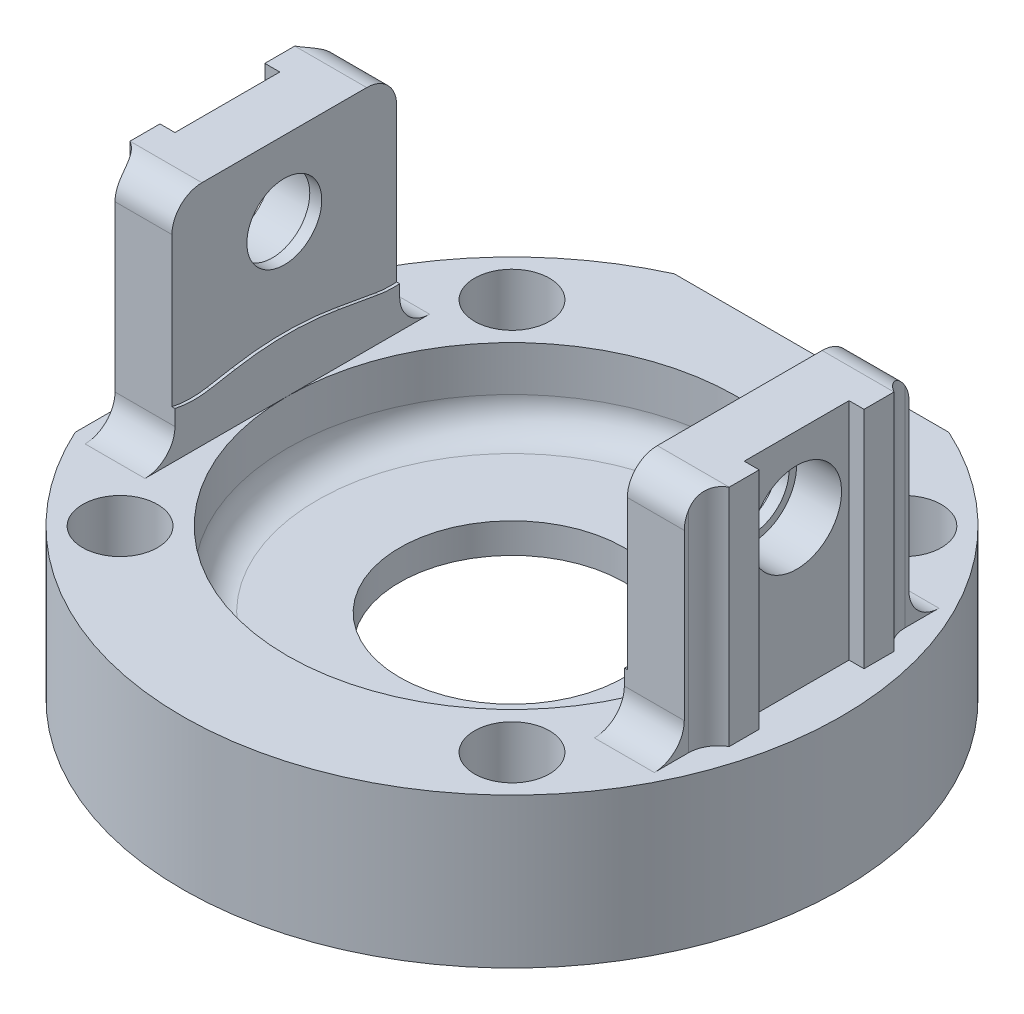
ISO-10303-21;
HEADER;
FILE_DESCRIPTION(('STEP AP214'),'2;1');
FILE_NAME('part.step','',(''),(''),'','','');
FILE_SCHEMA(('AUTOMOTIVE_DESIGN { 1 0 10303 214 1 1 1 1 }'));
ENDSEC;
DATA;
#1=APPLICATION_CONTEXT('core data for automotive mechanical design processes');
#2=APPLICATION_PROTOCOL_DEFINITION('international standard','automotive_design',2000,#1);
#3=PRODUCT_CONTEXT('',#1,'mechanical');
#4=PRODUCT('Part','Part','',(#3));
#5=PRODUCT_RELATED_PRODUCT_CATEGORY('part','',(#4));
#6=PRODUCT_DEFINITION_FORMATION('','',#4);
#7=PRODUCT_DEFINITION_CONTEXT('part definition',#1,'design');
#8=PRODUCT_DEFINITION('design','',#6,#7);
#9=PRODUCT_DEFINITION_SHAPE('','',#8);
#10=(LENGTH_UNIT() NAMED_UNIT(*) SI_UNIT(.MILLI.,.METRE.));
#11=(NAMED_UNIT(*) PLANE_ANGLE_UNIT() SI_UNIT($,.RADIAN.));
#12=(NAMED_UNIT(*) SI_UNIT($,.STERADIAN.) SOLID_ANGLE_UNIT());
#13=UNCERTAINTY_MEASURE_WITH_UNIT(LENGTH_MEASURE(1.E-05),#10,'distance_accuracy_value','');
#14=(GEOMETRIC_REPRESENTATION_CONTEXT(3) GLOBAL_UNCERTAINTY_ASSIGNED_CONTEXT((#13)) GLOBAL_UNIT_ASSIGNED_CONTEXT((#10,
#11,#12)) REPRESENTATION_CONTEXT('',''));
#15=CARTESIAN_POINT('',(0.,0.,0.));
#16=DIRECTION('',(0.,0.,1.));
#17=DIRECTION('',(1.,0.,0.));
#18=AXIS2_PLACEMENT_3D('',#15,#16,#17);
#19=CARTESIAN_POINT('',(27.,20.,0.));
#20=DIRECTION('',(-1.,0.,0.));
#21=DIRECTION('',(0.,0.,1.));
#22=AXIS2_PLACEMENT_3D('',#19,#20,#21);
#23=CYLINDRICAL_SURFACE('',#22,3.);
#24=CARTESIAN_POINT('',(-19.,20.,0.));
#25=DIRECTION('',(1.,0.,0.));
#26=DIRECTION('',(0.,0.,-1.));
#27=AXIS2_PLACEMENT_3D('',#24,#25,#26);
#28=CIRCLE('',#27,3.);
#29=CARTESIAN_POINT('',(-19.,20.,3.));
#30=VERTEX_POINT('',#29);
#31=EDGE_CURVE('E471',#30,#30,#28,.F.);
#32=CARTESIAN_POINT('',(-16.,20.,0.));
#33=DIRECTION('',(1.,0.,0.));
#34=DIRECTION('',(0.,0.,-1.));
#35=AXIS2_PLACEMENT_3D('',#32,#33,#34);
#36=CIRCLE('',#35,3.);
#37=CARTESIAN_POINT('',(-16.,20.,3.));
#38=VERTEX_POINT('',#37);
#39=EDGE_CURVE('E1551',#38,#38,#36,.T.);
#40=CARTESIAN_POINT('',(-19.,20.,3.));
#41=CARTESIAN_POINT('',(-18.96875,20.,3.));
#42=CARTESIAN_POINT('',(-18.9375,20.,3.));
#43=CARTESIAN_POINT('',(-18.875,20.,3.));
#44=CARTESIAN_POINT('',(-18.84375,20.,3.));
#45=CARTESIAN_POINT('',(-18.78125,20.,3.));
#46=CARTESIAN_POINT('',(-18.75,20.,3.));
#47=CARTESIAN_POINT('',(-18.6875,20.,3.));
#48=CARTESIAN_POINT('',(-18.65625,20.,3.));
#49=CARTESIAN_POINT('',(-18.59375,20.,3.));
#50=CARTESIAN_POINT('',(-18.5625,20.,3.));
#51=CARTESIAN_POINT('',(-18.5,20.,3.));
#52=CARTESIAN_POINT('',(-18.46875,20.,3.));
#53=CARTESIAN_POINT('',(-18.40625,20.,3.));
#54=CARTESIAN_POINT('',(-18.375,20.,3.));
#55=CARTESIAN_POINT('',(-18.3125,20.,3.));
#56=CARTESIAN_POINT('',(-18.28125,20.,3.));
#57=CARTESIAN_POINT('',(-18.21875,20.,3.));
#58=CARTESIAN_POINT('',(-18.1875,20.,3.));
#59=CARTESIAN_POINT('',(-18.125,20.,3.));
#60=CARTESIAN_POINT('',(-18.09375,20.,3.));
#61=CARTESIAN_POINT('',(-18.03125,20.,3.));
#62=CARTESIAN_POINT('',(-18.,20.,3.));
#63=CARTESIAN_POINT('',(-17.9375,20.,3.));
#64=CARTESIAN_POINT('',(-17.90625,20.,3.));
#65=CARTESIAN_POINT('',(-17.84375,20.,3.));
#66=CARTESIAN_POINT('',(-17.8125,20.,3.));
#67=CARTESIAN_POINT('',(-17.75,20.,3.));
#68=CARTESIAN_POINT('',(-17.71875,20.,3.));
#69=CARTESIAN_POINT('',(-17.65625,20.,3.));
#70=CARTESIAN_POINT('',(-17.625,20.,3.));
#71=CARTESIAN_POINT('',(-17.5625,20.,3.));
#72=CARTESIAN_POINT('',(-17.53125,20.,3.));
#73=CARTESIAN_POINT('',(-17.46875,20.,3.));
#74=CARTESIAN_POINT('',(-17.4375,20.,3.));
#75=CARTESIAN_POINT('',(-17.375,20.,3.));
#76=CARTESIAN_POINT('',(-17.34375,20.,3.));
#77=CARTESIAN_POINT('',(-17.28125,20.,3.));
#78=CARTESIAN_POINT('',(-17.25,20.,3.));
#79=CARTESIAN_POINT('',(-17.1875,20.,3.));
#80=CARTESIAN_POINT('',(-17.15625,20.,3.));
#81=CARTESIAN_POINT('',(-17.09375,20.,3.));
#82=CARTESIAN_POINT('',(-17.0625,20.,3.));
#83=CARTESIAN_POINT('',(-17.,20.,3.));
#84=CARTESIAN_POINT('',(-16.96875,20.,3.));
#85=CARTESIAN_POINT('',(-16.90625,20.,3.));
#86=CARTESIAN_POINT('',(-16.875,20.,3.));
#87=CARTESIAN_POINT('',(-16.8125,20.,3.));
#88=CARTESIAN_POINT('',(-16.78125,20.,3.));
#89=CARTESIAN_POINT('',(-16.71875,20.,3.));
#90=CARTESIAN_POINT('',(-16.6875,20.,3.));
#91=CARTESIAN_POINT('',(-16.625,20.,3.));
#92=CARTESIAN_POINT('',(-16.59375,20.,3.));
#93=CARTESIAN_POINT('',(-16.53125,20.,3.));
#94=CARTESIAN_POINT('',(-16.5,20.,3.));
#95=CARTESIAN_POINT('',(-16.4375,20.,3.));
#96=CARTESIAN_POINT('',(-16.40625,20.,3.));
#97=CARTESIAN_POINT('',(-16.34375,20.,3.));
#98=CARTESIAN_POINT('',(-16.3125,20.,3.));
#99=CARTESIAN_POINT('',(-16.25,20.,3.));
#100=CARTESIAN_POINT('',(-16.21875,20.,3.));
#101=CARTESIAN_POINT('',(-16.15625,20.,3.));
#102=CARTESIAN_POINT('',(-16.125,20.,3.));
#103=CARTESIAN_POINT('',(-16.0625,20.,3.));
#104=CARTESIAN_POINT('',(-16.03125,20.,3.));
#105=CARTESIAN_POINT('',(-16.,20.,3.));
#106=B_SPLINE_CURVE_WITH_KNOTS('',3,(#40,#41,#42,#43,#44,#45,#46,#47,#48,#49,#50,#51,#52,#53,
#54,#55,#56,#57,#58,#59,#60,#61,#62,#63,#64,#65,#66,#67,#68,#69,#70,#71,#72,#73,#74,#75,#76,#77,
#78,#79,#80,#81,#82,#83,#84,#85,#86,#87,#88,#89,#90,#91,#92,#93,#94,#95,#96,#97,#98,#99,#100,
#101,#102,#103,#104,#105),.UNSPECIFIED.,.F.,.F.,(4,2,2,2,2,2,2,2,2,2,2,2,2,2,2,2,2,2,2,2,2,2,2,
2,2,2,2,2,2,2,2,2,4),(0.,0.0937499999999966,0.1875,0.281249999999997,0.375,0.468749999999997,
0.5625,0.656249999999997,0.750000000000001,0.843749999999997,0.937499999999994,1.03125,
1.12499999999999,1.21875,1.31249999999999,1.40625,1.49999999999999,1.59374999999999,
1.68749999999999,1.78124999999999,1.87499999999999,1.96874999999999,2.06249999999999,
2.15624999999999,2.24999999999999,2.34374999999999,2.43749999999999,2.53124999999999,
2.62499999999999,2.71874999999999,2.81249999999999,2.90624999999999,2.99999999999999),.UNSPECIFIED.);
#107=EDGE_CURVE('BSEAM84',#30,#38,#106,.T.);
#108=ORIENTED_EDGE('',*,*,#31,.T.);
#109=ORIENTED_EDGE('',*,*,#39,.T.);
#110=ORIENTED_EDGE('',*,*,#107,.T.);
#111=ORIENTED_EDGE('',*,*,#107,.F.);
#112=EDGE_LOOP('',(#108,#110,#109,#111));
#113=FACE_BOUND('',#112,.T.);
#114=ADVANCED_FACE('F84',(#113),#23,.F.);
#115=CARTESIAN_POINT('',(19.,20.,0.));
#116=DIRECTION('',(1.,0.,0.));
#117=DIRECTION('',(0.,0.,-1.));
#118=AXIS2_PLACEMENT_3D('',#115,#116,#117);
#119=CIRCLE('',#118,3.);
#120=CARTESIAN_POINT('',(19.,20.,3.));
#121=VERTEX_POINT('',#120);
#122=EDGE_CURVE('E467',#121,#121,#119,.F.);
#123=CARTESIAN_POINT('',(16.,20.,0.));
#124=DIRECTION('',(-1.,0.,0.));
#125=DIRECTION('',(0.,0.,1.));
#126=AXIS2_PLACEMENT_3D('',#123,#124,#125);
#127=CIRCLE('',#126,3.);
#128=CARTESIAN_POINT('',(16.,20.,3.));
#129=VERTEX_POINT('',#128);
#130=EDGE_CURVE('E394',#129,#129,#127,.T.);
#131=CARTESIAN_POINT('',(19.,20.,3.));
#132=CARTESIAN_POINT('',(18.96875,20.,3.));
#133=CARTESIAN_POINT('',(18.9375,20.,3.));
#134=CARTESIAN_POINT('',(18.875,20.,3.));
#135=CARTESIAN_POINT('',(18.84375,20.,3.));
#136=CARTESIAN_POINT('',(18.78125,20.,3.));
#137=CARTESIAN_POINT('',(18.75,20.,3.));
#138=CARTESIAN_POINT('',(18.6875,20.,3.));
#139=CARTESIAN_POINT('',(18.65625,20.,3.));
#140=CARTESIAN_POINT('',(18.59375,20.,3.));
#141=CARTESIAN_POINT('',(18.5625,20.,3.));
#142=CARTESIAN_POINT('',(18.5,20.,3.));
#143=CARTESIAN_POINT('',(18.46875,20.,3.));
#144=CARTESIAN_POINT('',(18.40625,20.,3.));
#145=CARTESIAN_POINT('',(18.375,20.,3.));
#146=CARTESIAN_POINT('',(18.3125,20.,3.));
#147=CARTESIAN_POINT('',(18.28125,20.,3.));
#148=CARTESIAN_POINT('',(18.21875,20.,3.));
#149=CARTESIAN_POINT('',(18.1875,20.,3.));
#150=CARTESIAN_POINT('',(18.125,20.,3.));
#151=CARTESIAN_POINT('',(18.09375,20.,3.));
#152=CARTESIAN_POINT('',(18.03125,20.,3.));
#153=CARTESIAN_POINT('',(18.,20.,3.));
#154=CARTESIAN_POINT('',(17.9375,20.,3.));
#155=CARTESIAN_POINT('',(17.90625,20.,3.));
#156=CARTESIAN_POINT('',(17.84375,20.,3.));
#157=CARTESIAN_POINT('',(17.8125,20.,3.));
#158=CARTESIAN_POINT('',(17.75,20.,3.));
#159=CARTESIAN_POINT('',(17.71875,20.,3.));
#160=CARTESIAN_POINT('',(17.65625,20.,3.));
#161=CARTESIAN_POINT('',(17.625,20.,3.));
#162=CARTESIAN_POINT('',(17.5625,20.,3.));
#163=CARTESIAN_POINT('',(17.53125,20.,3.));
#164=CARTESIAN_POINT('',(17.46875,20.,3.));
#165=CARTESIAN_POINT('',(17.4375,20.,3.));
#166=CARTESIAN_POINT('',(17.375,20.,3.));
#167=CARTESIAN_POINT('',(17.34375,20.,3.));
#168=CARTESIAN_POINT('',(17.28125,20.,3.));
#169=CARTESIAN_POINT('',(17.25,20.,3.));
#170=CARTESIAN_POINT('',(17.1875,20.,3.));
#171=CARTESIAN_POINT('',(17.15625,20.,3.));
#172=CARTESIAN_POINT('',(17.09375,20.,3.));
#173=CARTESIAN_POINT('',(17.0625,20.,3.));
#174=CARTESIAN_POINT('',(17.,20.,3.));
#175=CARTESIAN_POINT('',(16.96875,20.,3.));
#176=CARTESIAN_POINT('',(16.90625,20.,3.));
#177=CARTESIAN_POINT('',(16.875,20.,3.));
#178=CARTESIAN_POINT('',(16.8125,20.,3.));
#179=CARTESIAN_POINT('',(16.78125,20.,3.));
#180=CARTESIAN_POINT('',(16.71875,20.,3.));
#181=CARTESIAN_POINT('',(16.6875,20.,3.));
#182=CARTESIAN_POINT('',(16.625,20.,3.));
#183=CARTESIAN_POINT('',(16.59375,20.,3.));
#184=CARTESIAN_POINT('',(16.53125,20.,3.));
#185=CARTESIAN_POINT('',(16.5,20.,3.));
#186=CARTESIAN_POINT('',(16.4375,20.,3.));
#187=CARTESIAN_POINT('',(16.40625,20.,3.));
#188=CARTESIAN_POINT('',(16.34375,20.,3.));
#189=CARTESIAN_POINT('',(16.3125,20.,3.));
#190=CARTESIAN_POINT('',(16.25,20.,3.));
#191=CARTESIAN_POINT('',(16.21875,20.,3.));
#192=CARTESIAN_POINT('',(16.15625,20.,3.));
#193=CARTESIAN_POINT('',(16.125,20.,3.));
#194=CARTESIAN_POINT('',(16.0625,20.,3.));
#195=CARTESIAN_POINT('',(16.03125,20.,3.));
#196=CARTESIAN_POINT('',(16.,20.,3.));
#197=B_SPLINE_CURVE_WITH_KNOTS('',3,(#131,#132,#133,#134,#135,#136,#137,#138,#139,#140,#141,
#142,#143,#144,#145,#146,#147,#148,#149,#150,#151,#152,#153,#154,#155,#156,#157,#158,#159,#160,
#161,#162,#163,#164,#165,#166,#167,#168,#169,#170,#171,#172,#173,#174,#175,#176,#177,#178,#179,
#180,#181,#182,#183,#184,#185,#186,#187,#188,#189,#190,#191,#192,#193,#194,#195,#196),
.UNSPECIFIED.,.F.,.F.,(4,2,2,2,2,2,2,2,2,2,2,2,2,2,2,2,2,2,2,2,2,2,2,2,2,2,2,2,2,2,2,2,4),(0.,
0.0937499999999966,0.1875,0.281249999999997,0.375,0.468749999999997,0.5625,0.656249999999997,
0.750000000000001,0.843749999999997,0.937499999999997,1.03125,1.125,1.21875,1.3125,1.40625,1.5,
1.59375,1.6875,1.78125,1.875,1.96875,2.06249999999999,2.15625,2.25,2.34375,2.4375,2.53125,2.625,
2.71875,2.8125,2.90625,3.),.UNSPECIFIED.);
#198=EDGE_CURVE('BSEAM540',#121,#129,#197,.T.);
#199=ORIENTED_EDGE('',*,*,#122,.F.);
#200=ORIENTED_EDGE('',*,*,#130,.T.);
#201=ORIENTED_EDGE('',*,*,#198,.T.);
#202=ORIENTED_EDGE('',*,*,#198,.F.);
#203=EDGE_LOOP('',(#199,#201,#200,#202));
#204=FACE_BOUND('',#203,.T.);
#205=ADVANCED_FACE('F540',(#204),#23,.F.);
#206=CARTESIAN_POINT('',(0.,25.,-7.5));
#207=DIRECTION('',(0.,0.,1.));
#208=DIRECTION('',(1.,0.,0.));
#209=AXIS2_PLACEMENT_3D('',#206,#207,#208);
#210=PLANE('',#209);
#211=DIRECTION('',(1.,0.,0.));
#212=VECTOR('',#211,1.);
#213=CARTESIAN_POINT('',(-15.2,12.7592898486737,-7.5));
#214=LINE('',#213,#212);
#215=CARTESIAN_POINT('',(-15.2,12.7592898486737,-7.5));
#216=VERTEX_POINT('',#215);
#217=CARTESIAN_POINT('',(-15.,12.7592898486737,-7.5));
#218=VERTEX_POINT('',#217);
#219=EDGE_CURVE('E1147',#216,#218,#214,.T.);
#220=ORIENTED_EDGE('',*,*,#219,.T.);
#221=DIRECTION('',(0.,-1.,0.));
#222=VECTOR('',#221,1.);
#223=CARTESIAN_POINT('',(-15.,25.,-7.5));
#224=LINE('',#223,#222);
#225=CARTESIAN_POINT('',(-15.,12.,-7.5));
#226=VERTEX_POINT('',#225);
#227=EDGE_CURVE('E1044',#218,#226,#224,.T.);
#228=ORIENTED_EDGE('',*,*,#227,.T.);
#229=DIRECTION('',(-1.,0.,0.));
#230=VECTOR('',#229,1.);
#231=CARTESIAN_POINT('',(0.,12.,-7.5));
#232=LINE('',#231,#230);
#233=CARTESIAN_POINT('',(-19.,12.,-7.5));
#234=VERTEX_POINT('',#233);
#235=EDGE_CURVE('E921',#226,#234,#232,.T.);
#236=ORIENTED_EDGE('',*,*,#235,.T.);
#237=DIRECTION('',(0.,-1.,0.));
#238=VECTOR('',#237,1.);
#239=CARTESIAN_POINT('',(-19.,25.,-7.5));
#240=LINE('',#239,#238);
#241=CARTESIAN_POINT('',(-19.,23.,-7.5));
#242=VERTEX_POINT('',#241);
#243=EDGE_CURVE('E835',#242,#234,#240,.T.);
#244=ORIENTED_EDGE('',*,*,#243,.F.);
#245=DIRECTION('',(-1.,0.,0.));
#246=VECTOR('',#245,1.);
#247=CARTESIAN_POINT('',(-15.,23.,-7.5));
#248=LINE('',#247,#246);
#249=CARTESIAN_POINT('',(-15.2,23.,-7.5));
#250=VERTEX_POINT('',#249);
#251=EDGE_CURVE('E917',#242,#250,#248,.F.);
#252=ORIENTED_EDGE('',*,*,#251,.T.);
#253=DIRECTION('',(0.,-1.,0.));
#254=VECTOR('',#253,1.);
#255=CARTESIAN_POINT('',(-15.2,0.,-7.5));
#256=LINE('',#255,#254);
#257=EDGE_CURVE('E1243',#250,#216,#256,.T.);
#258=ORIENTED_EDGE('',*,*,#257,.T.);
#259=EDGE_LOOP('',(#220,#228,#236,#244,#252,#258));
#260=FACE_BOUND('',#259,.T.);
#261=ADVANCED_FACE('F548',(#260),#210,.F.);
#262=CARTESIAN_POINT('',(0.,25.,7.5));
#263=DIRECTION('',(0.,0.,1.));
#264=DIRECTION('',(1.,0.,0.));
#265=AXIS2_PLACEMENT_3D('',#262,#263,#264);
#266=PLANE('',#265);
#267=DIRECTION('',(0.,-1.,0.));
#268=VECTOR('',#267,1.);
#269=CARTESIAN_POINT('',(-15.,25.,7.5));
#270=LINE('',#269,#268);
#271=CARTESIAN_POINT('',(-15.,13.0474267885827,7.5));
#272=VERTEX_POINT('',#271);
#273=CARTESIAN_POINT('',(-15.,12.,7.5));
#274=VERTEX_POINT('',#273);
#275=EDGE_CURVE('E1055',#272,#274,#270,.T.);
#276=ORIENTED_EDGE('',*,*,#275,.F.);
#277=DIRECTION('',(1.,0.,0.));
#278=VECTOR('',#277,1.);
#279=CARTESIAN_POINT('',(-15.2,13.0474267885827,7.5));
#280=LINE('',#279,#278);
#281=CARTESIAN_POINT('',(-15.2,13.0474267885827,7.5));
#282=VERTEX_POINT('',#281);
#283=EDGE_CURVE('E1262',#282,#272,#280,.T.);
#284=ORIENTED_EDGE('',*,*,#283,.F.);
#285=DIRECTION('',(0.,1.,0.));
#286=VECTOR('',#285,1.);
#287=CARTESIAN_POINT('',(-15.2,0.,7.5));
#288=LINE('',#287,#286);
#289=CARTESIAN_POINT('',(-15.2,23.,7.5));
#290=VERTEX_POINT('',#289);
#291=EDGE_CURVE('E1109',#282,#290,#288,.T.);
#292=ORIENTED_EDGE('',*,*,#291,.T.);
#293=DIRECTION('',(-1.,0.,0.));
#294=VECTOR('',#293,1.);
#295=CARTESIAN_POINT('',(0.,23.,7.5));
#296=LINE('',#295,#294);
#297=CARTESIAN_POINT('',(-19.,23.,7.5));
#298=VERTEX_POINT('',#297);
#299=EDGE_CURVE('E801',#290,#298,#296,.T.);
#300=ORIENTED_EDGE('',*,*,#299,.T.);
#301=DIRECTION('',(0.,-1.,0.));
#302=VECTOR('',#301,1.);
#303=CARTESIAN_POINT('',(-19.,25.,7.5));
#304=LINE('',#303,#302);
#305=CARTESIAN_POINT('',(-19.,12.,7.5));
#306=VERTEX_POINT('',#305);
#307=EDGE_CURVE('E798',#298,#306,#304,.T.);
#308=ORIENTED_EDGE('',*,*,#307,.T.);
#309=DIRECTION('',(-1.,0.,0.));
#310=VECTOR('',#309,1.);
#311=CARTESIAN_POINT('',(-15.,12.,7.5));
#312=LINE('',#311,#310);
#313=EDGE_CURVE('E948',#306,#274,#312,.F.);
#314=ORIENTED_EDGE('',*,*,#313,.T.);
#315=EDGE_LOOP('',(#276,#284,#292,#300,#308,#314));
#316=FACE_BOUND('',#315,.T.);
#317=ADVANCED_FACE('F601',(#316),#266,.T.);
#318=CARTESIAN_POINT('',(-15.,25.,0.));
#319=DIRECTION('',(1.,0.,0.));
#320=DIRECTION('',(0.,0.,-1.));
#321=AXIS2_PLACEMENT_3D('',#318,#319,#320);
#322=PLANE('',#321);
#323=DIRECTION('',(0.,-0.173648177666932,-0.984807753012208));
#324=VECTOR('',#323,1.);
#325=CARTESIAN_POINT('',(-15.,14.241921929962,1.89693942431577));
#326=LINE('',#325,#324);
#327=CARTESIAN_POINT('',(-15.,13.2950631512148,-3.47296355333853));
#328=VERTEX_POINT('',#327);
#329=CARTESIAN_POINT('',(-15.,12.8376776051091,-6.06692588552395));
#330=VERTEX_POINT('',#329);
#331=EDGE_CURVE('E472',#328,#330,#326,.T.);
#332=ORIENTED_EDGE('',*,*,#331,.F.);
#333=CARTESIAN_POINT('',(-15.,-6.40109190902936,1.01938133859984E-13));
#334=DIRECTION('',(1.,0.,0.));
#335=DIRECTION('',(0.,0.,-1.));
#336=AXIS2_PLACEMENT_3D('',#333,#334,#335);
#337=CIRCLE('',#336,20.);
#338=CARTESIAN_POINT('',(-15.,13.2950631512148,3.47296355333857));
#339=VERTEX_POINT('',#338);
#340=EDGE_CURVE('E756',#328,#339,#337,.T.);
#341=ORIENTED_EDGE('',*,*,#340,.T.);
#342=DIRECTION('',(0.,-0.173648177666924,0.984807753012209));
#343=VECTOR('',#342,1.);
#344=CARTESIAN_POINT('',(-15.,14.241921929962,-1.89693942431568));
#345=LINE('',#344,#343);
#346=CARTESIAN_POINT('',(-15.,12.9970964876,5.16281647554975));
#347=VERTEX_POINT('',#346);
#348=EDGE_CURVE('E1153',#339,#347,#345,.T.);
#349=ORIENTED_EDGE('',*,*,#348,.T.);
#350=CARTESIAN_POINT('',(-15.,18.9059430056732,6.20470554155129));
#351=DIRECTION('',(1.,0.,0.));
#352=DIRECTION('',(0.,0.,-1.));
#353=AXIS2_PLACEMENT_3D('',#350,#351,#352);
#354=CIRCLE('',#353,6.);
#355=EDGE_CURVE('E1144',#347,#272,#354,.F.);
#356=ORIENTED_EDGE('',*,*,#355,.T.);
#357=ORIENTED_EDGE('',*,*,#275,.T.);
#358=CARTESIAN_POINT('',(-15.,12.,9.5));
#359=DIRECTION('',(1.,0.,0.));
#360=DIRECTION('',(0.,0.,-1.));
#361=AXIS2_PLACEMENT_3D('',#358,#359,#360);
#362=CIRCLE('',#361,2.);
#363=CARTESIAN_POINT('',(-15.,10.,9.5));
#364=VERTEX_POINT('',#363);
#365=EDGE_CURVE('E437',#274,#364,#362,.F.);
#366=ORIENTED_EDGE('',*,*,#365,.T.);
#367=DIRECTION('',(0.,0.,1.));
#368=VECTOR('',#367,1.);
#369=CARTESIAN_POINT('',(-15.,10.,0.));
#370=LINE('',#369,#368);
#371=CARTESIAN_POINT('',(-15.,10.,0.));
#372=VERTEX_POINT('',#371);
#373=EDGE_CURVE('E916',#372,#364,#370,.T.);
#374=ORIENTED_EDGE('',*,*,#373,.F.);
#375=CARTESIAN_POINT('',(-15.,10.,-9.5));
#376=VERTEX_POINT('',#375);
#377=EDGE_CURVE('E1035',#376,#372,#370,.T.);
#378=ORIENTED_EDGE('',*,*,#377,.F.);
#379=CARTESIAN_POINT('',(-15.,12.,-9.5));
#380=DIRECTION('',(1.,0.,0.));
#381=DIRECTION('',(0.,0.,-1.));
#382=AXIS2_PLACEMENT_3D('',#379,#380,#381);
#383=CIRCLE('',#382,2.);
#384=EDGE_CURVE('E430',#376,#226,#383,.F.);
#385=ORIENTED_EDGE('',*,*,#384,.T.);
#386=ORIENTED_EDGE('',*,*,#227,.F.);
#387=CARTESIAN_POINT('',(-15.,18.7465241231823,-7.10881495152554));
#388=DIRECTION('',(1.,0.,0.));
#389=DIRECTION('',(0.,0.,-1.));
#390=AXIS2_PLACEMENT_3D('',#387,#388,#389);
#391=CIRCLE('',#390,6.);
#392=EDGE_CURVE('E1135',#218,#330,#391,.F.);
#393=ORIENTED_EDGE('',*,*,#392,.T.);
#394=EDGE_LOOP('',(#332,#341,#349,#356,#357,#366,#374,#378,#385,#386,#393));
#395=FACE_BOUND('',#394,.T.);
#396=ADVANCED_FACE('F574',(#395),#322,.T.);
#397=CARTESIAN_POINT('',(15.,25.,0.));
#398=DIRECTION('',(1.,0.,0.));
#399=DIRECTION('',(0.,0.,-1.));
#400=AXIS2_PLACEMENT_3D('',#397,#398,#399);
#401=PLANE('',#400);
#402=DIRECTION('',(0.,-0.173648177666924,0.984807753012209));
#403=VECTOR('',#402,1.);
#404=CARTESIAN_POINT('',(15.,14.241921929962,-1.89693942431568));
#405=LINE('',#404,#403);
#406=CARTESIAN_POINT('',(15.,13.2950631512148,3.47296355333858));
#407=VERTEX_POINT('',#406);
#408=CARTESIAN_POINT('',(15.,12.9970964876,5.16281647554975));
#409=VERTEX_POINT('',#408);
#410=EDGE_CURVE('E764',#407,#409,#405,.T.);
#411=ORIENTED_EDGE('',*,*,#410,.F.);
#412=CARTESIAN_POINT('',(15.,-6.40109190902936,1.05407580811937E-13));
#413=DIRECTION('',(1.,0.,0.));
#414=DIRECTION('',(0.,0.,-1.));
#415=AXIS2_PLACEMENT_3D('',#412,#413,#414);
#416=CIRCLE('',#415,20.);
#417=CARTESIAN_POINT('',(15.,13.2950631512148,-3.47296355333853));
#418=VERTEX_POINT('',#417);
#419=EDGE_CURVE('E744',#407,#418,#416,.F.);
#420=ORIENTED_EDGE('',*,*,#419,.T.);
#421=DIRECTION('',(0.,-0.173648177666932,-0.984807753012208));
#422=VECTOR('',#421,1.);
#423=CARTESIAN_POINT('',(15.,14.241921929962,1.89693942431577));
#424=LINE('',#423,#422);
#425=CARTESIAN_POINT('',(15.,12.8376776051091,-6.06692588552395));
#426=VERTEX_POINT('',#425);
#427=EDGE_CURVE('E761',#418,#426,#424,.T.);
#428=ORIENTED_EDGE('',*,*,#427,.T.);
#429=CARTESIAN_POINT('',(15.,18.7465241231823,-7.10881495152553));
#430=DIRECTION('',(1.,0.,0.));
#431=DIRECTION('',(0.,0.,-1.));
#432=AXIS2_PLACEMENT_3D('',#429,#430,#431);
#433=CIRCLE('',#432,6.);
#434=CARTESIAN_POINT('',(15.,12.7592898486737,-7.5));
#435=VERTEX_POINT('',#434);
#436=EDGE_CURVE('E1140',#435,#426,#433,.F.);
#437=ORIENTED_EDGE('',*,*,#436,.F.);
#438=DIRECTION('',(0.,-1.,0.));
#439=VECTOR('',#438,1.);
#440=CARTESIAN_POINT('',(15.,25.,-7.5));
#441=LINE('',#440,#439);
#442=CARTESIAN_POINT('',(15.,12.,-7.5));
#443=VERTEX_POINT('',#442);
#444=EDGE_CURVE('E983',#435,#443,#441,.T.);
#445=ORIENTED_EDGE('',*,*,#444,.T.);
#446=CARTESIAN_POINT('',(15.,12.,-9.5));
#447=DIRECTION('',(1.,0.,0.));
#448=DIRECTION('',(0.,0.,-1.));
#449=AXIS2_PLACEMENT_3D('',#446,#447,#448);
#450=CIRCLE('',#449,2.);
#451=CARTESIAN_POINT('',(15.,10.,-9.5));
#452=VERTEX_POINT('',#451);
#453=EDGE_CURVE('E444',#443,#452,#450,.T.);
#454=ORIENTED_EDGE('',*,*,#453,.T.);
#455=DIRECTION('',(0.,0.,1.));
#456=VECTOR('',#455,1.);
#457=CARTESIAN_POINT('',(15.,10.,0.));
#458=LINE('',#457,#456);
#459=CARTESIAN_POINT('',(15.,10.,0.));
#460=VERTEX_POINT('',#459);
#461=EDGE_CURVE('E1011',#452,#460,#458,.T.);
#462=ORIENTED_EDGE('',*,*,#461,.T.);
#463=CARTESIAN_POINT('',(15.,10.,9.5));
#464=VERTEX_POINT('',#463);
#465=EDGE_CURVE('E1016',#460,#464,#458,.T.);
#466=ORIENTED_EDGE('',*,*,#465,.T.);
#467=CARTESIAN_POINT('',(15.,12.,9.5));
#468=DIRECTION('',(1.,0.,0.));
#469=DIRECTION('',(0.,0.,-1.));
#470=AXIS2_PLACEMENT_3D('',#467,#468,#469);
#471=CIRCLE('',#470,2.);
#472=CARTESIAN_POINT('',(15.,12.,7.5));
#473=VERTEX_POINT('',#472);
#474=EDGE_CURVE('E452',#464,#473,#471,.T.);
#475=ORIENTED_EDGE('',*,*,#474,.T.);
#476=DIRECTION('',(0.,-1.,0.));
#477=VECTOR('',#476,1.);
#478=CARTESIAN_POINT('',(15.,25.,7.5));
#479=LINE('',#478,#477);
#480=CARTESIAN_POINT('',(15.,13.0474267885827,7.5));
#481=VERTEX_POINT('',#480);
#482=EDGE_CURVE('E970',#481,#473,#479,.T.);
#483=ORIENTED_EDGE('',*,*,#482,.F.);
#484=CARTESIAN_POINT('',(15.,18.9059430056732,6.2047055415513));
#485=DIRECTION('',(1.,0.,0.));
#486=DIRECTION('',(0.,0.,-1.));
#487=AXIS2_PLACEMENT_3D('',#484,#485,#486);
#488=CIRCLE('',#487,6.);
#489=EDGE_CURVE('E1139',#409,#481,#488,.F.);
#490=ORIENTED_EDGE('',*,*,#489,.F.);
#491=EDGE_LOOP('',(#411,#420,#428,#437,#445,#454,#462,#466,#475,#483,#490));
#492=FACE_BOUND('',#491,.T.);
#493=ADVANCED_FACE('F571',(#492),#401,.F.);
#494=CARTESIAN_POINT('',(0.,25.,7.5));
#495=DIRECTION('',(0.,0.,-1.));
#496=DIRECTION('',(-1.,0.,0.));
#497=AXIS2_PLACEMENT_3D('',#494,#495,#496);
#498=PLANE('',#497);
#499=CARTESIAN_POINT('',(15.2,13.0474267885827,7.5));
#500=VERTEX_POINT('',#499);
#501=EDGE_CURVE('E1261',#481,#500,#280,.T.);
#502=ORIENTED_EDGE('',*,*,#501,.F.);
#503=ORIENTED_EDGE('',*,*,#482,.T.);
#504=DIRECTION('',(1.,0.,0.));
#505=VECTOR('',#504,1.);
#506=CARTESIAN_POINT('',(0.,12.,7.5));
#507=LINE('',#506,#505);
#508=CARTESIAN_POINT('',(19.,12.,7.5));
#509=VERTEX_POINT('',#508);
#510=EDGE_CURVE('E420',#473,#509,#507,.T.);
#511=ORIENTED_EDGE('',*,*,#510,.T.);
#512=DIRECTION('',(0.,-1.,0.));
#513=VECTOR('',#512,1.);
#514=CARTESIAN_POINT('',(19.,25.,7.5));
#515=LINE('',#514,#513);
#516=CARTESIAN_POINT('',(19.,23.,7.5));
#517=VERTEX_POINT('',#516);
#518=EDGE_CURVE('E968',#517,#509,#515,.T.);
#519=ORIENTED_EDGE('',*,*,#518,.F.);
#520=DIRECTION('',(1.,0.,0.));
#521=VECTOR('',#520,1.);
#522=CARTESIAN_POINT('',(15.,23.,7.5));
#523=LINE('',#522,#521);
#524=CARTESIAN_POINT('',(15.2,23.,7.5));
#525=VERTEX_POINT('',#524);
#526=EDGE_CURVE('E960',#517,#525,#523,.F.);
#527=ORIENTED_EDGE('',*,*,#526,.T.);
#528=DIRECTION('',(0.,1.,0.));
#529=VECTOR('',#528,1.);
#530=CARTESIAN_POINT('',(15.2,0.,7.5));
#531=LINE('',#530,#529);
#532=EDGE_CURVE('E388',#500,#525,#531,.T.);
#533=ORIENTED_EDGE('',*,*,#532,.F.);
#534=EDGE_LOOP('',(#502,#503,#511,#519,#527,#533));
#535=FACE_BOUND('',#534,.T.);
#536=ADVANCED_FACE('F569',(#535),#498,.F.);
#537=CARTESIAN_POINT('',(0.,25.,-7.5));
#538=DIRECTION('',(0.,0.,-1.));
#539=DIRECTION('',(-1.,0.,0.));
#540=AXIS2_PLACEMENT_3D('',#537,#538,#539);
#541=PLANE('',#540);
#542=ORIENTED_EDGE('',*,*,#444,.F.);
#543=CARTESIAN_POINT('',(15.2,12.7592898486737,-7.5));
#544=VERTEX_POINT('',#543);
#545=EDGE_CURVE('E1273',#435,#544,#214,.T.);
#546=ORIENTED_EDGE('',*,*,#545,.T.);
#547=DIRECTION('',(0.,-1.,0.));
#548=VECTOR('',#547,1.);
#549=CARTESIAN_POINT('',(15.2,0.,-7.5));
#550=LINE('',#549,#548);
#551=CARTESIAN_POINT('',(15.2,23.,-7.5));
#552=VERTEX_POINT('',#551);
#553=EDGE_CURVE('E1219',#552,#544,#550,.T.);
#554=ORIENTED_EDGE('',*,*,#553,.F.);
#555=DIRECTION('',(1.,0.,0.));
#556=VECTOR('',#555,1.);
#557=CARTESIAN_POINT('',(0.,23.,-7.5));
#558=LINE('',#557,#556);
#559=CARTESIAN_POINT('',(19.,23.,-7.5));
#560=VERTEX_POINT('',#559);
#561=EDGE_CURVE('E800',#552,#560,#558,.T.);
#562=ORIENTED_EDGE('',*,*,#561,.T.);
#563=DIRECTION('',(0.,-1.,0.));
#564=VECTOR('',#563,1.);
#565=CARTESIAN_POINT('',(19.,25.,-7.5));
#566=LINE('',#565,#564);
#567=CARTESIAN_POINT('',(19.,12.,-7.5));
#568=VERTEX_POINT('',#567);
#569=EDGE_CURVE('E994',#560,#568,#566,.T.);
#570=ORIENTED_EDGE('',*,*,#569,.T.);
#571=DIRECTION('',(1.,0.,0.));
#572=VECTOR('',#571,1.);
#573=CARTESIAN_POINT('',(15.,12.,-7.5));
#574=LINE('',#573,#572);
#575=EDGE_CURVE('E956',#568,#443,#574,.F.);
#576=ORIENTED_EDGE('',*,*,#575,.T.);
#577=EDGE_LOOP('',(#542,#546,#554,#562,#570,#576));
#578=FACE_BOUND('',#577,.T.);
#579=ADVANCED_FACE('F566',(#578),#541,.T.);
#580=CARTESIAN_POINT('',(0.,25.,0.));
#581=DIRECTION('',(0.,1.,0.));
#582=DIRECTION('',(0.,0.,1.));
#583=AXIS2_PLACEMENT_3D('',#580,#581,#582);
#584=PLANE('',#583);
#585=DIRECTION('',(1.,0.,0.));
#586=VECTOR('',#585,1.);
#587=CARTESIAN_POINT('',(0.,25.,-5.5));
#588=LINE('',#587,#586);
#589=CARTESIAN_POINT('',(20.,25.,-5.5));
#590=VERTEX_POINT('',#589);
#591=CARTESIAN_POINT('',(15.2,25.,-5.5));
#592=VERTEX_POINT('',#591);
#593=EDGE_CURVE('E403',#590,#592,#588,.F.);
#594=ORIENTED_EDGE('',*,*,#593,.T.);
#595=DIRECTION('',(0.,0.,-1.));
#596=VECTOR('',#595,1.);
#597=CARTESIAN_POINT('',(15.2,25.,0.));
#598=LINE('',#597,#596);
#599=CARTESIAN_POINT('',(15.2,25.,5.5));
#600=VERTEX_POINT('',#599);
#601=EDGE_CURVE('E384',#600,#592,#598,.T.);
#602=ORIENTED_EDGE('',*,*,#601,.F.);
#603=DIRECTION('',(1.,0.,0.));
#604=VECTOR('',#603,1.);
#605=CARTESIAN_POINT('',(19.,25.,5.5));
#606=LINE('',#605,#604);
#607=CARTESIAN_POINT('',(20.,25.,5.5));
#608=VERTEX_POINT('',#607);
#609=EDGE_CURVE('E400',#600,#608,#606,.T.);
#610=ORIENTED_EDGE('',*,*,#609,.T.);
#611=DIRECTION('',(0.,0.,1.));
#612=VECTOR('',#611,1.);
#613=CARTESIAN_POINT('',(20.,25.,3.5));
#614=LINE('',#613,#612);
#615=CARTESIAN_POINT('',(20.,25.,3.5));
#616=VERTEX_POINT('',#615);
#617=EDGE_CURVE('E1165',#616,#608,#614,.T.);
#618=ORIENTED_EDGE('',*,*,#617,.F.);
#619=DIRECTION('',(1.,0.,0.));
#620=VECTOR('',#619,1.);
#621=CARTESIAN_POINT('',(19.,25.,3.5));
#622=LINE('',#621,#620);
#623=CARTESIAN_POINT('',(19.,25.,3.5));
#624=VERTEX_POINT('',#623);
#625=EDGE_CURVE('E1172',#624,#616,#622,.T.);
#626=ORIENTED_EDGE('',*,*,#625,.F.);
#627=DIRECTION('',(0.,0.,1.));
#628=VECTOR('',#627,1.);
#629=CARTESIAN_POINT('',(19.,25.,0.));
#630=LINE('',#629,#628);
#631=CARTESIAN_POINT('',(19.,25.,-3.5));
#632=VERTEX_POINT('',#631);
#633=EDGE_CURVE('E1023',#632,#624,#630,.T.);
#634=ORIENTED_EDGE('',*,*,#633,.F.);
#635=DIRECTION('',(1.,0.,0.));
#636=VECTOR('',#635,1.);
#637=CARTESIAN_POINT('',(0.,25.,-3.50000000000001));
#638=LINE('',#637,#636);
#639=CARTESIAN_POINT('',(20.,25.,-3.5));
#640=VERTEX_POINT('',#639);
#641=EDGE_CURVE('E1020',#632,#640,#638,.T.);
#642=ORIENTED_EDGE('',*,*,#641,.T.);
#643=DIRECTION('',(0.,0.,1.));
#644=VECTOR('',#643,1.);
#645=CARTESIAN_POINT('',(20.,25.,0.));
#646=LINE('',#645,#644);
#647=EDGE_CURVE('E998',#590,#640,#646,.T.);
#648=ORIENTED_EDGE('',*,*,#647,.F.);
#649=EDGE_LOOP('',(#594,#602,#610,#618,#626,#634,#642,#648));
#650=FACE_BOUND('',#649,.T.);
#651=ADVANCED_FACE('F398',(#650),#584,.T.);
#652=CARTESIAN_POINT('',(0.,23.,-5.5));
#653=DIRECTION('',(1.,0.,0.));
#654=DIRECTION('',(0.,0.,-1.));
#655=AXIS2_PLACEMENT_3D('',#652,#653,#654);
#656=CYLINDRICAL_SURFACE('',#655,2.);
#657=ORIENTED_EDGE('',*,*,#561,.F.);
#658=CARTESIAN_POINT('',(15.2,23.,-5.5));
#659=DIRECTION('',(-1.,0.,0.));
#660=DIRECTION('',(0.,0.,1.));
#661=AXIS2_PLACEMENT_3D('',#658,#659,#660);
#662=CIRCLE('',#661,2.);
#663=EDGE_CURVE('E405',#592,#552,#662,.T.);
#664=ORIENTED_EDGE('',*,*,#663,.F.);
#665=ORIENTED_EDGE('',*,*,#593,.F.);
#666=CARTESIAN_POINT('',(20.,25.,-5.5));
#667=CARTESIAN_POINT('',(19.9579316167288,24.9999953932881,-5.52428852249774));
#668=CARTESIAN_POINT('',(19.9167620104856,24.9995572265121,-5.55010292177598));
#669=CARTESIAN_POINT('',(19.836406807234,24.9974478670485,-5.6046559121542));
#670=CARTESIAN_POINT('',(19.7972224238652,24.9957759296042,-5.63339626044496));
#671=CARTESIAN_POINT('',(19.6827098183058,24.9883414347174,-5.72399886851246));
#672=CARTESIAN_POINT('',(19.6107484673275,24.9801545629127,-5.79005407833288));
#673=CARTESIAN_POINT('',(19.4776420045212,24.9542593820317,-5.93132440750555));
#674=CARTESIAN_POINT('',(19.4165510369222,24.9365050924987,-6.00658239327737));
#675=CARTESIAN_POINT('',(19.3074860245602,24.8889010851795,-6.16229220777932));
#676=CARTESIAN_POINT('',(19.2594691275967,24.8590916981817,-6.24272597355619));
#677=CARTESIAN_POINT('',(19.1806814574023,24.7892817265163,-6.39722295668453));
#678=CARTESIAN_POINT('',(19.1487575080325,24.7504218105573,-6.47121730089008));
#679=CARTESIAN_POINT('',(19.0955405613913,24.6615929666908,-6.61640219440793));
#680=CARTESIAN_POINT('',(19.0742592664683,24.6116118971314,-6.68758957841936));
#681=CARTESIAN_POINT('',(19.0412580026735,24.5030606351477,-6.82215537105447));
#682=CARTESIAN_POINT('',(19.029297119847,24.4447564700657,-6.88569190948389));
#683=CARTESIAN_POINT('',(19.0120068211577,24.3199372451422,-7.00506381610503));
#684=CARTESIAN_POINT('',(19.0066743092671,24.2534260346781,-7.06090276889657));
#685=CARTESIAN_POINT('',(19.0022946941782,24.154078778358,-7.13384441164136));
#686=CARTESIAN_POINT('',(19.0013961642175,24.1239873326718,-7.15468862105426));
#687=CARTESIAN_POINT('',(19.0002503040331,24.062765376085,-7.19465648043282));
#688=CARTESIAN_POINT('',(19.0000015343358,24.0316373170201,-7.21378384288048));
#689=CARTESIAN_POINT('',(19.,24.,-7.23205080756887));
#690=B_SPLINE_CURVE_WITH_KNOTS('',3,(#666,#667,#668,#669,#670,#671,#672,#673,#674,#675,#676,
#677,#678,#679,#680,#681,#682,#683,#684,#685,#686,#687,#688,#689),.UNSPECIFIED.,.F.,.F.,(4,2,2,
2,2,2,2,2,2,2,2,4),(0.,0.145660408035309,0.291408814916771,0.584024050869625,0.878058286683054,
1.1711168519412,1.43813989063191,1.70545589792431,1.96560924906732,2.2256410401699,
2.33544360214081,2.4450027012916),.UNSPECIFIED.);
#691=CARTESIAN_POINT('',(19.,24.,-7.23205080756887));
#692=VERTEX_POINT('',#691);
#693=EDGE_CURVE('E507',#590,#692,#690,.T.);
#694=ORIENTED_EDGE('',*,*,#693,.T.);
#695=CARTESIAN_POINT('',(19.,23.,-5.5));
#696=DIRECTION('',(1.,0.,0.));
#697=DIRECTION('',(0.,0.,-1.));
#698=AXIS2_PLACEMENT_3D('',#695,#696,#697);
#699=CIRCLE('',#698,2.);
#700=EDGE_CURVE('E413',#560,#692,#699,.T.);
#701=ORIENTED_EDGE('',*,*,#700,.F.);
#702=EDGE_LOOP('',(#657,#664,#665,#694,#701));
#703=FACE_BOUND('',#702,.T.);
#704=ADVANCED_FACE('F521',(#703),#656,.T.);
#705=CARTESIAN_POINT('',(0.,23.,5.5));
#706=DIRECTION('',(-1.,0.,0.));
#707=DIRECTION('',(0.,0.,1.));
#708=AXIS2_PLACEMENT_3D('',#705,#706,#707);
#709=CYLINDRICAL_SURFACE('',#708,2.);
#710=ORIENTED_EDGE('',*,*,#609,.F.);
#711=CARTESIAN_POINT('',(15.2,23.,5.5));
#712=DIRECTION('',(-1.,0.,0.));
#713=DIRECTION('',(0.,0.,1.));
#714=AXIS2_PLACEMENT_3D('',#711,#712,#713);
#715=CIRCLE('',#714,2.);
#716=EDGE_CURVE('E380',#525,#600,#715,.T.);
#717=ORIENTED_EDGE('',*,*,#716,.F.);
#718=ORIENTED_EDGE('',*,*,#526,.F.);
#719=CARTESIAN_POINT('',(19.,23.,5.5));
#720=DIRECTION('',(1.,0.,0.));
#721=DIRECTION('',(0.,0.,-1.));
#722=AXIS2_PLACEMENT_3D('',#719,#720,#721);
#723=CIRCLE('',#722,2.);
#724=CARTESIAN_POINT('',(19.,24.,7.23205080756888));
#725=VERTEX_POINT('',#724);
#726=EDGE_CURVE('E417',#725,#517,#723,.T.);
#727=ORIENTED_EDGE('',*,*,#726,.F.);
#728=CARTESIAN_POINT('',(19.,24.,7.23205080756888));
#729=CARTESIAN_POINT('',(19.0000046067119,24.0420683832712,7.20776228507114));
#730=CARTESIAN_POINT('',(19.0004427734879,24.0832379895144,7.18194788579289));
#731=CARTESIAN_POINT('',(19.0025521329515,24.163593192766,7.12739489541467));
#732=CARTESIAN_POINT('',(19.0042240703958,24.2027775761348,7.09865454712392));
#733=CARTESIAN_POINT('',(19.0116585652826,24.3172901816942,7.00805193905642));
#734=CARTESIAN_POINT('',(19.0198454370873,24.3892515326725,6.94199672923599));
#735=CARTESIAN_POINT('',(19.0457406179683,24.5223579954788,6.80072640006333));
#736=CARTESIAN_POINT('',(19.0634949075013,24.5834489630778,6.7254684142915));
#737=CARTESIAN_POINT('',(19.1110989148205,24.6925139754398,6.56975859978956));
#738=CARTESIAN_POINT('',(19.1409083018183,24.7405308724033,6.48932483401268));
#739=CARTESIAN_POINT('',(19.2107182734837,24.8193185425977,6.33482785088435));
#740=CARTESIAN_POINT('',(19.2495781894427,24.8512424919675,6.26083350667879));
#741=CARTESIAN_POINT('',(19.3384070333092,24.9044594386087,6.11564861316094));
#742=CARTESIAN_POINT('',(19.3883881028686,24.9257407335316,6.04446122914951));
#743=CARTESIAN_POINT('',(19.4969393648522,24.9587419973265,5.90989543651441));
#744=CARTESIAN_POINT('',(19.5552435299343,24.970702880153,5.84635889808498));
#745=CARTESIAN_POINT('',(19.6800627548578,24.9879931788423,5.72698699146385));
#746=CARTESIAN_POINT('',(19.7465739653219,24.9933256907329,5.67114803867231));
#747=CARTESIAN_POINT('',(19.845921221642,24.9977053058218,5.59820639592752));
#748=CARTESIAN_POINT('',(19.8760126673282,24.9986038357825,5.57736218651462));
#749=CARTESIAN_POINT('',(19.937234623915,24.9997496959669,5.53739432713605));
#750=CARTESIAN_POINT('',(19.9683626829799,24.9999984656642,5.51826696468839));
#751=CARTESIAN_POINT('',(20.,25.,5.5));
#752=B_SPLINE_CURVE_WITH_KNOTS('',3,(#728,#729,#730,#731,#732,#733,#734,#735,#736,#737,#738,
#739,#740,#741,#742,#743,#744,#745,#746,#747,#748,#749,#750,#751),.UNSPECIFIED.,.F.,.F.,(4,2,2,
2,2,2,2,2,2,2,2,4),(0.,0.145660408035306,0.291408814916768,0.584024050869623,0.878058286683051,
1.17111685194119,1.4381398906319,1.70545589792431,1.96560924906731,2.22564104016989,
2.3354436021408,2.4450027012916),.UNSPECIFIED.);
#753=EDGE_CURVE('E410',#725,#608,#752,.T.);
#754=ORIENTED_EDGE('',*,*,#753,.T.);
#755=EDGE_LOOP('',(#710,#717,#718,#727,#754));
#756=FACE_BOUND('',#755,.T.);
#757=ADVANCED_FACE('F408',(#756),#709,.T.);
#758=CARTESIAN_POINT('',(0.,10.,0.));
#759=DIRECTION('',(0.,1.,0.));
#760=DIRECTION('',(0.,0.,1.));
#761=AXIS2_PLACEMENT_3D('',#758,#759,#760);
#762=PLANE('',#761);
#763=DIRECTION('',(0.,0.,1.));
#764=VECTOR('',#763,1.);
#765=CARTESIAN_POINT('',(20.,10.,3.5));
#766=LINE('',#765,#764);
#767=CARTESIAN_POINT('',(20.,10.,3.5));
#768=VERTEX_POINT('',#767);
#769=CARTESIAN_POINT('',(20.,10.,5.5));
#770=VERTEX_POINT('',#769);
#771=EDGE_CURVE('E1169',#768,#770,#766,.T.);
#772=ORIENTED_EDGE('',*,*,#771,.T.);
#773=CARTESIAN_POINT('',(21.,10.,7.23205080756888));
#774=DIRECTION('',(0.,1.,0.));
#775=DIRECTION('',(0.,0.,1.));
#776=AXIS2_PLACEMENT_3D('',#773,#774,#775);
#777=CIRCLE('',#776,2.);
#778=CARTESIAN_POINT('',(19.,10.,7.23205080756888));
#779=VERTEX_POINT('',#778);
#780=EDGE_CURVE('E485',#770,#779,#777,.T.);
#781=ORIENTED_EDGE('',*,*,#780,.T.);
#782=DIRECTION('',(0.,0.,1.));
#783=VECTOR('',#782,1.);
#784=CARTESIAN_POINT('',(19.,10.,0.));
#785=LINE('',#784,#783);
#786=CARTESIAN_POINT('',(19.,10.,9.5));
#787=VERTEX_POINT('',#786);
#788=EDGE_CURVE('E1010',#779,#787,#785,.T.);
#789=ORIENTED_EDGE('',*,*,#788,.T.);
#790=DIRECTION('',(1.,0.,0.));
#791=VECTOR('',#790,1.);
#792=CARTESIAN_POINT('',(0.,10.,9.5));
#793=LINE('',#792,#791);
#794=EDGE_CURVE('E925',#787,#464,#793,.F.);
#795=ORIENTED_EDGE('',*,*,#794,.T.);
#796=ORIENTED_EDGE('',*,*,#465,.F.);
#797=CARTESIAN_POINT('',(0.,10.,0.));
#798=DIRECTION('',(0.,1.,0.));
#799=DIRECTION('',(0.,0.,1.));
#800=AXIS2_PLACEMENT_3D('',#797,#798,#799);
#801=CIRCLE('',#800,15.);
#802=EDGE_CURVE('E892',#372,#460,#801,.T.);
#803=ORIENTED_EDGE('',*,*,#802,.F.);
#804=ORIENTED_EDGE('',*,*,#373,.T.);
#805=DIRECTION('',(-1.,0.,0.));
#806=VECTOR('',#805,1.);
#807=CARTESIAN_POINT('',(-19.,10.,9.5));
#808=LINE('',#807,#806);
#809=CARTESIAN_POINT('',(-19.,10.,9.5));
#810=VERTEX_POINT('',#809);
#811=EDGE_CURVE('E933',#364,#810,#808,.T.);
#812=ORIENTED_EDGE('',*,*,#811,.T.);
#813=DIRECTION('',(0.,0.,1.));
#814=VECTOR('',#813,1.);
#815=CARTESIAN_POINT('',(-19.,10.,0.));
#816=LINE('',#815,#814);
#817=CARTESIAN_POINT('',(-19.,10.,7.23205080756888));
#818=VERTEX_POINT('',#817);
#819=EDGE_CURVE('E812',#818,#810,#816,.T.);
#820=ORIENTED_EDGE('',*,*,#819,.F.);
#821=CARTESIAN_POINT('',(-21.,10.,7.23205080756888));
#822=DIRECTION('',(0.,1.,0.));
#823=DIRECTION('',(0.,0.,1.));
#824=AXIS2_PLACEMENT_3D('',#821,#822,#823);
#825=CIRCLE('',#824,2.);
#826=CARTESIAN_POINT('',(-20.,10.,5.5));
#827=VERTEX_POINT('',#826);
#828=EDGE_CURVE('E476',#818,#827,#825,.T.);
#829=ORIENTED_EDGE('',*,*,#828,.T.);
#830=DIRECTION('',(0.,0.,-1.));
#831=VECTOR('',#830,1.);
#832=CARTESIAN_POINT('',(-20.,10.,-14.6899001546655));
#833=LINE('',#832,#831);
#834=CARTESIAN_POINT('',(-20.,10.,9.16515138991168));
#835=VERTEX_POINT('',#834);
#836=EDGE_CURVE('E809',#835,#827,#833,.T.);
#837=ORIENTED_EDGE('',*,*,#836,.F.);
#838=CARTESIAN_POINT('',(0.,10.,0.));
#839=DIRECTION('',(0.,1.,0.));
#840=DIRECTION('',(0.,0.,1.));
#841=AXIS2_PLACEMENT_3D('',#838,#839,#840);
#842=CIRCLE('',#841,22.);
#843=CARTESIAN_POINT('',(9.16515138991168,10.,-20.));
#844=VERTEX_POINT('',#843);
#845=EDGE_CURVE('E897',#835,#844,#842,.T.);
#846=ORIENTED_EDGE('',*,*,#845,.T.);
#847=DIRECTION('',(1.,0.,0.));
#848=VECTOR('',#847,1.);
#849=CARTESIAN_POINT('',(-13.5509601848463,10.,-20.));
#850=LINE('',#849,#848);
#851=CARTESIAN_POINT('',(-9.16515138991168,10.,-20.));
#852=VERTEX_POINT('',#851);
#853=EDGE_CURVE('E830',#852,#844,#850,.T.);
#854=ORIENTED_EDGE('',*,*,#853,.F.);
#855=CARTESIAN_POINT('',(-20.,10.,-9.16515138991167));
#856=VERTEX_POINT('',#855);
#857=EDGE_CURVE('E900',#852,#856,#842,.T.);
#858=ORIENTED_EDGE('',*,*,#857,.T.);
#859=CARTESIAN_POINT('',(-20.,10.,-5.5));
#860=VERTEX_POINT('',#859);
#861=EDGE_CURVE('E821',#860,#856,#833,.T.);
#862=ORIENTED_EDGE('',*,*,#861,.F.);
#863=CARTESIAN_POINT('',(-21.,10.,-7.23205080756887));
#864=DIRECTION('',(0.,1.,0.));
#865=DIRECTION('',(0.,0.,1.));
#866=AXIS2_PLACEMENT_3D('',#863,#864,#865);
#867=CIRCLE('',#866,2.);
#868=CARTESIAN_POINT('',(-19.,10.,-7.23205080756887));
#869=VERTEX_POINT('',#868);
#870=EDGE_CURVE('E479',#860,#869,#867,.T.);
#871=ORIENTED_EDGE('',*,*,#870,.T.);
#872=CARTESIAN_POINT('',(-19.,10.,-9.5));
#873=VERTEX_POINT('',#872);
#874=EDGE_CURVE('E1045',#873,#869,#816,.T.);
#875=ORIENTED_EDGE('',*,*,#874,.F.);
#876=DIRECTION('',(-1.,0.,0.));
#877=VECTOR('',#876,1.);
#878=CARTESIAN_POINT('',(0.,10.,-9.5));
#879=LINE('',#878,#877);
#880=EDGE_CURVE('E936',#873,#376,#879,.F.);
#881=ORIENTED_EDGE('',*,*,#880,.T.);
#882=ORIENTED_EDGE('',*,*,#377,.T.);
#883=EDGE_CURVE('E891',#460,#372,#801,.T.);
#884=ORIENTED_EDGE('',*,*,#883,.F.);
#885=ORIENTED_EDGE('',*,*,#461,.F.);
#886=DIRECTION('',(1.,0.,0.));
#887=VECTOR('',#886,1.);
#888=CARTESIAN_POINT('',(19.,10.,-9.5));
#889=LINE('',#888,#887);
#890=CARTESIAN_POINT('',(19.,10.,-9.5));
#891=VERTEX_POINT('',#890);
#892=EDGE_CURVE('E929',#452,#891,#889,.T.);
#893=ORIENTED_EDGE('',*,*,#892,.T.);
#894=CARTESIAN_POINT('',(19.,10.,-7.23205080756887));
#895=VERTEX_POINT('',#894);
#896=EDGE_CURVE('E1003',#891,#895,#785,.T.);
#897=ORIENTED_EDGE('',*,*,#896,.T.);
#898=CARTESIAN_POINT('',(21.,10.,-7.23205080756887));
#899=DIRECTION('',(0.,1.,0.));
#900=DIRECTION('',(0.,0.,1.));
#901=AXIS2_PLACEMENT_3D('',#898,#899,#900);
#902=CIRCLE('',#901,2.);
#903=CARTESIAN_POINT('',(20.,10.,-5.5));
#904=VERTEX_POINT('',#903);
#905=EDGE_CURVE('E482',#895,#904,#902,.T.);
#906=ORIENTED_EDGE('',*,*,#905,.T.);
#907=DIRECTION('',(0.,0.,1.));
#908=VECTOR('',#907,1.);
#909=CARTESIAN_POINT('',(20.,10.,0.));
#910=LINE('',#909,#908);
#911=CARTESIAN_POINT('',(20.,10.,-3.5));
#912=VERTEX_POINT('',#911);
#913=EDGE_CURVE('E999',#904,#912,#910,.T.);
#914=ORIENTED_EDGE('',*,*,#913,.T.);
#915=DIRECTION('',(1.,0.,0.));
#916=VECTOR('',#915,1.);
#917=CARTESIAN_POINT('',(0.,10.,-3.50000000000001));
#918=LINE('',#917,#916);
#919=CARTESIAN_POINT('',(19.,10.,-3.5));
#920=VERTEX_POINT('',#919);
#921=EDGE_CURVE('E1002',#920,#912,#918,.T.);
#922=ORIENTED_EDGE('',*,*,#921,.F.);
#923=CARTESIAN_POINT('',(19.,10.,3.5));
#924=VERTEX_POINT('',#923);
#925=EDGE_CURVE('E1007',#920,#924,#785,.T.);
#926=ORIENTED_EDGE('',*,*,#925,.T.);
#927=DIRECTION('',(1.,0.,0.));
#928=VECTOR('',#927,1.);
#929=CARTESIAN_POINT('',(19.,10.,3.5));
#930=LINE('',#929,#928);
#931=EDGE_CURVE('E1049',#924,#768,#930,.T.);
#932=ORIENTED_EDGE('',*,*,#931,.T.);
#933=EDGE_LOOP('',(#772,#781,#789,#795,#796,#803,#804,#812,#820,#829,#837,#846,#854,#858,#862,
#871,#875,#881,#882,#884,#885,#893,#897,#906,#914,#922,#926,#932));
#934=FACE_BOUND('',#933,.T.);
#935=CARTESIAN_POINT('',(13.081475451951,10.,13.0814754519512));
#936=DIRECTION('',(0.,1.,0.));
#937=DIRECTION('',(0.,0.,1.));
#938=AXIS2_PLACEMENT_3D('',#935,#936,#937);
#939=CIRCLE('',#938,2.5);
#940=CARTESIAN_POINT('',(13.081475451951,10.,15.5814754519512));
#941=VERTEX_POINT('',#940);
#942=EDGE_CURVE('E850',#941,#941,#939,.T.);
#943=ORIENTED_EDGE('',*,*,#942,.F.);
#944=EDGE_LOOP('',(#943));
#945=FACE_BOUND('',#944,.T.);
#946=CARTESIAN_POINT('',(-13.0814754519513,10.,13.081475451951));
#947=DIRECTION('',(0.,1.,0.));
#948=DIRECTION('',(0.,0.,1.));
#949=AXIS2_PLACEMENT_3D('',#946,#947,#948);
#950=CIRCLE('',#949,2.5);
#951=CARTESIAN_POINT('',(-13.0814754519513,10.,15.581475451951));
#952=VERTEX_POINT('',#951);
#953=EDGE_CURVE('E864',#952,#952,#950,.T.);
#954=ORIENTED_EDGE('',*,*,#953,.F.);
#955=EDGE_LOOP('',(#954));
#956=FACE_BOUND('',#955,.T.);
#957=CARTESIAN_POINT('',(-13.0814754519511,10.,-13.0814754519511));
#958=DIRECTION('',(0.,1.,0.));
#959=DIRECTION('',(0.,0.,1.));
#960=AXIS2_PLACEMENT_3D('',#957,#958,#959);
#961=CIRCLE('',#960,2.5);
#962=CARTESIAN_POINT('',(-13.0814754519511,10.,-10.5814754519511));
#963=VERTEX_POINT('',#962);
#964=EDGE_CURVE('E856',#963,#963,#961,.T.);
#965=ORIENTED_EDGE('',*,*,#964,.F.);
#966=EDGE_LOOP('',(#965));
#967=FACE_BOUND('',#966,.T.);
#968=CARTESIAN_POINT('',(13.0814754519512,10.,-13.0814754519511));
#969=DIRECTION('',(0.,1.,0.));
#970=DIRECTION('',(0.,0.,1.));
#971=AXIS2_PLACEMENT_3D('',#968,#969,#970);
#972=CIRCLE('',#971,2.5);
#973=CARTESIAN_POINT('',(13.0814754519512,10.,-10.5814754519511));
#974=VERTEX_POINT('',#973);
#975=EDGE_CURVE('E855',#974,#974,#972,.T.);
#976=ORIENTED_EDGE('',*,*,#975,.F.);
#977=EDGE_LOOP('',(#976));
#978=FACE_BOUND('',#977,.T.);
#979=ADVANCED_FACE('F520',(#934,#945,#956,#967,#978),#762,.T.);
#980=CARTESIAN_POINT('',(0.,10.,0.));
#981=DIRECTION('',(0.,-1.,0.));
#982=DIRECTION('',(0.,0.,-1.));
#983=AXIS2_PLACEMENT_3D('',#980,#981,#982);
#984=CYLINDRICAL_SURFACE('',#983,22.);
#985=ORIENTED_EDGE('',*,*,#845,.F.);
#986=DIRECTION('',(0.,-1.,0.));
#987=VECTOR('',#986,1.);
#988=CARTESIAN_POINT('',(-20.,10.,9.16515138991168));
#989=LINE('',#988,#987);
#990=CARTESIAN_POINT('',(-20.,0.,9.16515138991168));
#991=VERTEX_POINT('',#990);
#992=EDGE_CURVE('E816',#835,#991,#989,.T.);
#993=ORIENTED_EDGE('',*,*,#992,.T.);
#994=CARTESIAN_POINT('',(0.,0.,0.));
#995=DIRECTION('',(0.,1.,0.));
#996=DIRECTION('',(0.,0.,1.));
#997=AXIS2_PLACEMENT_3D('',#994,#995,#996);
#998=CIRCLE('',#997,22.);
#999=CARTESIAN_POINT('',(9.16515138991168,0.,-20.));
#1000=VERTEX_POINT('',#999);
#1001=EDGE_CURVE('E896',#991,#1000,#998,.T.);
#1002=ORIENTED_EDGE('',*,*,#1001,.T.);
#1003=DIRECTION('',(0.,-1.,0.));
#1004=VECTOR('',#1003,1.);
#1005=CARTESIAN_POINT('',(9.16515138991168,10.,-20.));
#1006=LINE('',#1005,#1004);
#1007=EDGE_CURVE('E818',#1000,#844,#1006,.F.);
#1008=ORIENTED_EDGE('',*,*,#1007,.T.);
#1009=EDGE_LOOP('',(#985,#993,#1002,#1008));
#1010=FACE_BOUND('',#1009,.T.);
#1011=ADVANCED_FACE('F668',(#1010),#984,.T.);
#1012=CARTESIAN_POINT('',(-9.16515138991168,0.,-20.));
#1013=VERTEX_POINT('',#1012);
#1014=CARTESIAN_POINT('',(-20.,0.,-9.16515138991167));
#1015=VERTEX_POINT('',#1014);
#1016=EDGE_CURVE('E901',#1013,#1015,#998,.T.);
#1017=ORIENTED_EDGE('',*,*,#1016,.T.);
#1018=DIRECTION('',(0.,-1.,0.));
#1019=VECTOR('',#1018,1.);
#1020=CARTESIAN_POINT('',(-20.,10.,-9.16515138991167));
#1021=LINE('',#1020,#1019);
#1022=EDGE_CURVE('E845',#1015,#856,#1021,.F.);
#1023=ORIENTED_EDGE('',*,*,#1022,.T.);
#1024=ORIENTED_EDGE('',*,*,#857,.F.);
#1025=DIRECTION('',(0.,-1.,0.));
#1026=VECTOR('',#1025,1.);
#1027=CARTESIAN_POINT('',(-9.16515138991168,10.,-20.));
#1028=LINE('',#1027,#1026);
#1029=EDGE_CURVE('E825',#852,#1013,#1028,.T.);
#1030=ORIENTED_EDGE('',*,*,#1029,.T.);
#1031=EDGE_LOOP('',(#1017,#1023,#1024,#1030));
#1032=FACE_BOUND('',#1031,.T.);
#1033=ADVANCED_FACE('F672',(#1032),#984,.T.);
#1034=CARTESIAN_POINT('',(0.,0.,0.));
#1035=DIRECTION('',(0.,1.,0.));
#1036=DIRECTION('',(0.,0.,1.));
#1037=AXIS2_PLACEMENT_3D('',#1034,#1035,#1036);
#1038=PLANE('',#1037);
#1039=CARTESIAN_POINT('',(13.081475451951,0.,13.0814754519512));
#1040=DIRECTION('',(0.,1.,0.));
#1041=DIRECTION('',(0.,0.,1.));
#1042=AXIS2_PLACEMENT_3D('',#1039,#1040,#1041);
#1043=CIRCLE('',#1042,2.5);
#1044=CARTESIAN_POINT('',(13.081475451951,0.,15.5814754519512));
#1045=VERTEX_POINT('',#1044);
#1046=EDGE_CURVE('E868',#1045,#1045,#1043,.T.);
#1047=ORIENTED_EDGE('',*,*,#1046,.T.);
#1048=EDGE_LOOP('',(#1047));
#1049=FACE_BOUND('',#1048,.T.);
#1050=CARTESIAN_POINT('',(-13.0814754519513,0.,13.081475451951));
#1051=DIRECTION('',(0.,1.,0.));
#1052=DIRECTION('',(0.,0.,1.));
#1053=AXIS2_PLACEMENT_3D('',#1050,#1051,#1052);
#1054=CIRCLE('',#1053,2.5);
#1055=CARTESIAN_POINT('',(-13.0814754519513,0.,15.581475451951));
#1056=VERTEX_POINT('',#1055);
#1057=EDGE_CURVE('E860',#1056,#1056,#1054,.T.);
#1058=ORIENTED_EDGE('',*,*,#1057,.T.);
#1059=EDGE_LOOP('',(#1058));
#1060=FACE_BOUND('',#1059,.T.);
#1061=CARTESIAN_POINT('',(-13.0814754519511,0.,-13.0814754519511));
#1062=DIRECTION('',(0.,1.,0.));
#1063=DIRECTION('',(0.,0.,1.));
#1064=AXIS2_PLACEMENT_3D('',#1061,#1062,#1063);
#1065=CIRCLE('',#1064,2.5);
#1066=CARTESIAN_POINT('',(-13.0814754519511,0.,-10.5814754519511));
#1067=VERTEX_POINT('',#1066);
#1068=EDGE_CURVE('E851',#1067,#1067,#1065,.T.);
#1069=ORIENTED_EDGE('',*,*,#1068,.T.);
#1070=EDGE_LOOP('',(#1069));
#1071=FACE_BOUND('',#1070,.T.);
#1072=CARTESIAN_POINT('',(13.0814754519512,0.,-13.0814754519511));
#1073=DIRECTION('',(0.,1.,0.));
#1074=DIRECTION('',(0.,0.,1.));
#1075=AXIS2_PLACEMENT_3D('',#1072,#1073,#1074);
#1076=CIRCLE('',#1075,2.5);
#1077=CARTESIAN_POINT('',(13.0814754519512,0.,-10.5814754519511));
#1078=VERTEX_POINT('',#1077);
#1079=EDGE_CURVE('E875',#1078,#1078,#1076,.T.);
#1080=ORIENTED_EDGE('',*,*,#1079,.T.);
#1081=EDGE_LOOP('',(#1080));
#1082=FACE_BOUND('',#1081,.T.);
#1083=CARTESIAN_POINT('',(0.,0.,0.));
#1084=DIRECTION('',(0.,-1.,0.));
#1085=DIRECTION('',(0.,0.,-1.));
#1086=AXIS2_PLACEMENT_3D('',#1083,#1084,#1085);
#1087=CIRCLE('',#1086,15.);
#1088=CARTESIAN_POINT('',(0.,0.,-15.));
#1089=VERTEX_POINT('',#1088);
#1090=EDGE_CURVE('E887',#1089,#1089,#1087,.T.);
#1091=ORIENTED_EDGE('',*,*,#1090,.F.);
#1092=EDGE_LOOP('',(#1091));
#1093=FACE_BOUND('',#1092,.T.);
#1094=ORIENTED_EDGE('',*,*,#1001,.F.);
#1095=DIRECTION('',(0.,0.,-1.));
#1096=VECTOR('',#1095,1.);
#1097=CARTESIAN_POINT('',(-20.,0.,0.));
#1098=LINE('',#1097,#1096);
#1099=EDGE_CURVE('E912',#991,#1015,#1098,.T.);
#1100=ORIENTED_EDGE('',*,*,#1099,.T.);
#1101=ORIENTED_EDGE('',*,*,#1016,.F.);
#1102=DIRECTION('',(1.,0.,0.));
#1103=VECTOR('',#1102,1.);
#1104=CARTESIAN_POINT('',(0.,0.,-20.));
#1105=LINE('',#1104,#1103);
#1106=EDGE_CURVE('E908',#1013,#1000,#1105,.T.);
#1107=ORIENTED_EDGE('',*,*,#1106,.T.);
#1108=EDGE_LOOP('',(#1094,#1100,#1101,#1107));
#1109=FACE_BOUND('',#1108,.T.);
#1110=ADVANCED_FACE('F664',(#1049,#1060,#1071,#1082,#1093,#1109),#1038,.F.);
#1111=CARTESIAN_POINT('',(0.,5.,0.));
#1112=DIRECTION('',(0.,1.,0.));
#1113=DIRECTION('',(0.,0.,1.));
#1114=AXIS2_PLACEMENT_3D('',#1111,#1112,#1113);
#1115=CYLINDRICAL_SURFACE('',#1114,15.);
#1116=CARTESIAN_POINT('',(0.,7.,0.));
#1117=DIRECTION('',(0.,1.,0.));
#1118=DIRECTION('',(0.,0.,1.));
#1119=AXIS2_PLACEMENT_3D('',#1116,#1117,#1118);
#1120=CIRCLE('',#1119,15.);
#1121=CARTESIAN_POINT('',(0.,7.,15.));
#1122=VERTEX_POINT('',#1121);
#1123=EDGE_CURVE('E767',#1122,#1122,#1120,.F.);
#1124=ORIENTED_EDGE('',*,*,#1123,.T.);
#1125=EDGE_LOOP('',(#1124));
#1126=FACE_BOUND('',#1125,.T.);
#1127=ORIENTED_EDGE('',*,*,#802,.T.);
#1128=ORIENTED_EDGE('',*,*,#883,.T.);
#1129=EDGE_LOOP('',(#1127,#1128));
#1130=FACE_BOUND('',#1129,.T.);
#1131=ADVANCED_FACE('F660',(#1126,#1130),#1115,.F.);
#1132=CARTESIAN_POINT('',(0.,5.,0.));
#1133=DIRECTION('',(0.,1.,0.));
#1134=DIRECTION('',(0.,0.,1.));
#1135=AXIS2_PLACEMENT_3D('',#1132,#1133,#1134);
#1136=PLANE('',#1135);
#1137=CARTESIAN_POINT('',(0.,5.,0.));
#1138=DIRECTION('',(0.,1.,0.));
#1139=DIRECTION('',(0.,0.,1.));
#1140=AXIS2_PLACEMENT_3D('',#1137,#1138,#1139);
#1141=CIRCLE('',#1140,13.);
#1142=CARTESIAN_POINT('',(0.,5.,13.));
#1143=VERTEX_POINT('',#1142);
#1144=EDGE_CURVE('E771',#1143,#1143,#1141,.T.);
#1145=ORIENTED_EDGE('',*,*,#1144,.T.);
#1146=EDGE_LOOP('',(#1145));
#1147=FACE_BOUND('',#1146,.T.);
#1148=CARTESIAN_POINT('',(0.,5.,0.));
#1149=DIRECTION('',(0.,1.,0.));
#1150=DIRECTION('',(0.,0.,1.));
#1151=AXIS2_PLACEMENT_3D('',#1148,#1149,#1150);
#1152=CIRCLE('',#1151,7.5);
#1153=CARTESIAN_POINT('',(0.,5.,7.5));
#1154=VERTEX_POINT('',#1153);
#1155=EDGE_CURVE('E886',#1154,#1154,#1152,.T.);
#1156=ORIENTED_EDGE('',*,*,#1155,.F.);
#1157=EDGE_LOOP('',(#1156));
#1158=FACE_BOUND('',#1157,.T.);
#1159=ADVANCED_FACE('F656',(#1147,#1158),#1136,.T.);
#1160=CARTESIAN_POINT('',(0.,3.,0.));
#1161=DIRECTION('',(0.,-1.,0.));
#1162=DIRECTION('',(0.,0.,-1.));
#1163=AXIS2_PLACEMENT_3D('',#1160,#1161,#1162);
#1164=CYLINDRICAL_SURFACE('',#1163,15.);
#1165=CARTESIAN_POINT('',(0.,1.,0.));
#1166=DIRECTION('',(0.,-1.,0.));
#1167=DIRECTION('',(0.,0.,-1.));
#1168=AXIS2_PLACEMENT_3D('',#1165,#1166,#1167);
#1169=CIRCLE('',#1168,15.);
#1170=CARTESIAN_POINT('',(0.,1.,-15.));
#1171=VERTEX_POINT('',#1170);
#1172=EDGE_CURVE('E775',#1171,#1171,#1169,.F.);
#1173=ORIENTED_EDGE('',*,*,#1172,.T.);
#1174=EDGE_LOOP('',(#1173));
#1175=FACE_BOUND('',#1174,.T.);
#1176=ORIENTED_EDGE('',*,*,#1090,.T.);
#1177=EDGE_LOOP('',(#1176));
#1178=FACE_BOUND('',#1177,.T.);
#1179=ADVANCED_FACE('F652',(#1175,#1178),#1164,.F.);
#1180=CARTESIAN_POINT('',(0.,3.,0.));
#1181=DIRECTION('',(0.,-1.,0.));
#1182=DIRECTION('',(0.,0.,-1.));
#1183=AXIS2_PLACEMENT_3D('',#1180,#1181,#1182);
#1184=PLANE('',#1183);
#1185=CARTESIAN_POINT('',(0.,3.,0.));
#1186=DIRECTION('',(0.,-1.,0.));
#1187=DIRECTION('',(0.,0.,-1.));
#1188=AXIS2_PLACEMENT_3D('',#1185,#1186,#1187);
#1189=CIRCLE('',#1188,13.);
#1190=CARTESIAN_POINT('',(0.,3.,-13.));
#1191=VERTEX_POINT('',#1190);
#1192=EDGE_CURVE('E778',#1191,#1191,#1189,.T.);
#1193=ORIENTED_EDGE('',*,*,#1192,.T.);
#1194=EDGE_LOOP('',(#1193));
#1195=FACE_BOUND('',#1194,.T.);
#1196=CARTESIAN_POINT('',(0.,3.,0.));
#1197=DIRECTION('',(0.,-1.,0.));
#1198=DIRECTION('',(0.,0.,-1.));
#1199=AXIS2_PLACEMENT_3D('',#1196,#1197,#1198);
#1200=CIRCLE('',#1199,7.5);
#1201=CARTESIAN_POINT('',(0.,3.,-7.5));
#1202=VERTEX_POINT('',#1201);
#1203=EDGE_CURVE('E879',#1202,#1202,#1200,.T.);
#1204=ORIENTED_EDGE('',*,*,#1203,.F.);
#1205=EDGE_LOOP('',(#1204));
#1206=FACE_BOUND('',#1205,.T.);
#1207=ADVANCED_FACE('F648',(#1195,#1206),#1184,.T.);
#1208=CARTESIAN_POINT('',(0.,6.,0.));
#1209=DIRECTION('',(0.,-1.,0.));
#1210=DIRECTION('',(0.,0.,-1.));
#1211=AXIS2_PLACEMENT_3D('',#1208,#1209,#1210);
#1212=CYLINDRICAL_SURFACE('',#1211,7.5);
#1213=ORIENTED_EDGE('',*,*,#1155,.T.);
#1214=EDGE_LOOP('',(#1213));
#1215=FACE_BOUND('',#1214,.T.);
#1216=ORIENTED_EDGE('',*,*,#1203,.T.);
#1217=EDGE_LOOP('',(#1216));
#1218=FACE_BOUND('',#1217,.T.);
#1219=ADVANCED_FACE('F644',(#1215,#1218),#1212,.F.);
#1220=CARTESIAN_POINT('',(13.0814754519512,0.,-13.0814754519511));
#1221=DIRECTION('',(0.,1.,0.));
#1222=DIRECTION('',(0.,0.,1.));
#1223=AXIS2_PLACEMENT_3D('',#1220,#1221,#1222);
#1224=CYLINDRICAL_SURFACE('',#1223,2.5);
#1225=ORIENTED_EDGE('',*,*,#1079,.F.);
#1226=EDGE_LOOP('',(#1225));
#1227=FACE_BOUND('',#1226,.T.);
#1228=ORIENTED_EDGE('',*,*,#975,.T.);
#1229=EDGE_LOOP('',(#1228));
#1230=FACE_BOUND('',#1229,.T.);
#1231=ADVANCED_FACE('F634',(#1227,#1230),#1224,.F.);
#1232=CARTESIAN_POINT('',(-13.0814754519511,0.,-13.0814754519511));
#1233=DIRECTION('',(0.,1.,0.));
#1234=DIRECTION('',(0.,0.,1.));
#1235=AXIS2_PLACEMENT_3D('',#1232,#1233,#1234);
#1236=CYLINDRICAL_SURFACE('',#1235,2.5);
#1237=ORIENTED_EDGE('',*,*,#1068,.F.);
#1238=EDGE_LOOP('',(#1237));
#1239=FACE_BOUND('',#1238,.T.);
#1240=ORIENTED_EDGE('',*,*,#964,.T.);
#1241=EDGE_LOOP('',(#1240));
#1242=FACE_BOUND('',#1241,.T.);
#1243=ADVANCED_FACE('F630',(#1239,#1242),#1236,.F.);
#1244=CARTESIAN_POINT('',(-13.0814754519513,0.,13.081475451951));
#1245=DIRECTION('',(0.,1.,0.));
#1246=DIRECTION('',(0.,0.,1.));
#1247=AXIS2_PLACEMENT_3D('',#1244,#1245,#1246);
#1248=CYLINDRICAL_SURFACE('',#1247,2.5);
#1249=ORIENTED_EDGE('',*,*,#1057,.F.);
#1250=EDGE_LOOP('',(#1249));
#1251=FACE_BOUND('',#1250,.T.);
#1252=ORIENTED_EDGE('',*,*,#953,.T.);
#1253=EDGE_LOOP('',(#1252));
#1254=FACE_BOUND('',#1253,.T.);
#1255=ADVANCED_FACE('F633',(#1251,#1254),#1248,.F.);
#1256=CARTESIAN_POINT('',(13.081475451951,0.,13.0814754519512));
#1257=DIRECTION('',(0.,1.,0.));
#1258=DIRECTION('',(0.,0.,1.));
#1259=AXIS2_PLACEMENT_3D('',#1256,#1257,#1258);
#1260=CYLINDRICAL_SURFACE('',#1259,2.5);
#1261=ORIENTED_EDGE('',*,*,#1046,.F.);
#1262=EDGE_LOOP('',(#1261));
#1263=FACE_BOUND('',#1262,.T.);
#1264=ORIENTED_EDGE('',*,*,#942,.T.);
#1265=EDGE_LOOP('',(#1264));
#1266=FACE_BOUND('',#1265,.T.);
#1267=ADVANCED_FACE('F628',(#1263,#1266),#1260,.F.);
#1268=CARTESIAN_POINT('',(-13.5509601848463,0.,-20.));
#1269=DIRECTION('',(0.,0.,1.));
#1270=DIRECTION('',(1.,0.,0.));
#1271=AXIS2_PLACEMENT_3D('',#1268,#1269,#1270);
#1272=PLANE('',#1271);
#1273=CARTESIAN_POINT('',(5.,5.,-20.));
#1274=DIRECTION('',(0.,0.,-1.));
#1275=DIRECTION('',(-1.,0.,0.));
#1276=AXIS2_PLACEMENT_3D('',#1273,#1274,#1275);
#1277=CIRCLE('',#1276,2.5);
#1278=CARTESIAN_POINT('',(2.5,5.,-20.));
#1279=VERTEX_POINT('',#1278);
#1280=EDGE_CURVE('E1540',#1279,#1279,#1277,.T.);
#1281=ORIENTED_EDGE('',*,*,#1280,.F.);
#1282=EDGE_LOOP('',(#1281));
#1283=FACE_BOUND('',#1282,.T.);
#1284=CARTESIAN_POINT('',(-5.,5.,-20.));
#1285=DIRECTION('',(0.,0.,-1.));
#1286=DIRECTION('',(-1.,0.,0.));
#1287=AXIS2_PLACEMENT_3D('',#1284,#1285,#1286);
#1288=CIRCLE('',#1287,2.5);
#1289=CARTESIAN_POINT('',(-7.5,5.,-20.));
#1290=VERTEX_POINT('',#1289);
#1291=EDGE_CURVE('E1522',#1290,#1290,#1288,.T.);
#1292=ORIENTED_EDGE('',*,*,#1291,.F.);
#1293=EDGE_LOOP('',(#1292));
#1294=FACE_BOUND('',#1293,.T.);
#1295=ORIENTED_EDGE('',*,*,#853,.T.);
#1296=ORIENTED_EDGE('',*,*,#1007,.F.);
#1297=ORIENTED_EDGE('',*,*,#1106,.F.);
#1298=ORIENTED_EDGE('',*,*,#1029,.F.);
#1299=EDGE_LOOP('',(#1295,#1296,#1297,#1298));
#1300=FACE_BOUND('',#1299,.T.);
#1301=ADVANCED_FACE('F624',(#1283,#1294,#1300),#1272,.F.);
#1302=CARTESIAN_POINT('',(-20.,0.,-14.6899001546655));
#1303=DIRECTION('',(1.,0.,0.));
#1304=DIRECTION('',(0.,0.,-1.));
#1305=AXIS2_PLACEMENT_3D('',#1302,#1303,#1304);
#1306=PLANE('',#1305);
#1307=CARTESIAN_POINT('',(-20.,5.,-5.));
#1308=DIRECTION('',(-1.,0.,0.));
#1309=DIRECTION('',(0.,0.,1.));
#1310=AXIS2_PLACEMENT_3D('',#1307,#1308,#1309);
#1311=CIRCLE('',#1310,2.5);
#1312=CARTESIAN_POINT('',(-20.,5.,-2.5));
#1313=VERTEX_POINT('',#1312);
#1314=EDGE_CURVE('E1517',#1313,#1313,#1311,.T.);
#1315=ORIENTED_EDGE('',*,*,#1314,.F.);
#1316=EDGE_LOOP('',(#1315));
#1317=FACE_BOUND('',#1316,.T.);
#1318=CARTESIAN_POINT('',(-20.,5.,5.));
#1319=DIRECTION('',(-1.,0.,0.));
#1320=DIRECTION('',(0.,0.,1.));
#1321=AXIS2_PLACEMENT_3D('',#1318,#1319,#1320);
#1322=CIRCLE('',#1321,2.5);
#1323=CARTESIAN_POINT('',(-20.,5.,7.5));
#1324=VERTEX_POINT('',#1323);
#1325=EDGE_CURVE('E1525',#1324,#1324,#1322,.T.);
#1326=ORIENTED_EDGE('',*,*,#1325,.F.);
#1327=EDGE_LOOP('',(#1326));
#1328=FACE_BOUND('',#1327,.T.);
#1329=ORIENTED_EDGE('',*,*,#836,.T.);
#1330=DIRECTION('',(0.,-1.,0.));
#1331=VECTOR('',#1330,1.);
#1332=CARTESIAN_POINT('',(-20.,25.,5.5));
#1333=LINE('',#1332,#1331);
#1334=CARTESIAN_POINT('',(-20.,25.,5.5));
#1335=VERTEX_POINT('',#1334);
#1336=EDGE_CURVE('E804',#1335,#827,#1333,.T.);
#1337=ORIENTED_EDGE('',*,*,#1336,.F.);
#1338=DIRECTION('',(0.,0.,1.));
#1339=VECTOR('',#1338,1.);
#1340=CARTESIAN_POINT('',(-20.,25.,0.));
#1341=LINE('',#1340,#1339);
#1342=CARTESIAN_POINT('',(-20.,25.,3.5));
#1343=VERTEX_POINT('',#1342);
#1344=EDGE_CURVE('E1041',#1343,#1335,#1341,.T.);
#1345=ORIENTED_EDGE('',*,*,#1344,.F.);
#1346=DIRECTION('',(0.,-1.,0.));
#1347=VECTOR('',#1346,1.);
#1348=CARTESIAN_POINT('',(-20.,25.,3.5));
#1349=LINE('',#1348,#1347);
#1350=CARTESIAN_POINT('',(-20.,10.,3.5));
#1351=VERTEX_POINT('',#1350);
#1352=EDGE_CURVE('E1062',#1343,#1351,#1349,.T.);
#1353=ORIENTED_EDGE('',*,*,#1352,.T.);
#1354=CARTESIAN_POINT('',(-20.,10.,-3.5));
#1355=VERTEX_POINT('',#1354);
#1356=EDGE_CURVE('E819',#1351,#1355,#833,.T.);
#1357=ORIENTED_EDGE('',*,*,#1356,.T.);
#1358=DIRECTION('',(0.,-1.,0.));
#1359=VECTOR('',#1358,1.);
#1360=CARTESIAN_POINT('',(-20.,25.,-3.5));
#1361=LINE('',#1360,#1359);
#1362=CARTESIAN_POINT('',(-20.,25.,-3.5));
#1363=VERTEX_POINT('',#1362);
#1364=EDGE_CURVE('E1074',#1363,#1355,#1361,.T.);
#1365=ORIENTED_EDGE('',*,*,#1364,.F.);
#1366=DIRECTION('',(0.,0.,1.));
#1367=VECTOR('',#1366,1.);
#1368=CARTESIAN_POINT('',(-20.,25.,0.));
#1369=LINE('',#1368,#1367);
#1370=CARTESIAN_POINT('',(-20.,25.,-5.5));
#1371=VERTEX_POINT('',#1370);
#1372=EDGE_CURVE('E1032',#1371,#1363,#1369,.T.);
#1373=ORIENTED_EDGE('',*,*,#1372,.F.);
#1374=DIRECTION('',(0.,-1.,0.));
#1375=VECTOR('',#1374,1.);
#1376=CARTESIAN_POINT('',(-20.,25.,-5.5));
#1377=LINE('',#1376,#1375);
#1378=EDGE_CURVE('E840',#1371,#860,#1377,.T.);
#1379=ORIENTED_EDGE('',*,*,#1378,.T.);
#1380=ORIENTED_EDGE('',*,*,#861,.T.);
#1381=ORIENTED_EDGE('',*,*,#1022,.F.);
#1382=ORIENTED_EDGE('',*,*,#1099,.F.);
#1383=ORIENTED_EDGE('',*,*,#992,.F.);
#1384=EDGE_LOOP('',(#1329,#1337,#1345,#1353,#1357,#1365,#1373,#1379,#1380,#1381,#1382,#1383));
#1385=FACE_BOUND('',#1384,.T.);
#1386=ADVANCED_FACE('F621',(#1317,#1328,#1385),#1306,.F.);
#1387=CARTESIAN_POINT('',(-19.,25.,0.));
#1388=DIRECTION('',(1.,0.,0.));
#1389=DIRECTION('',(0.,0.,-1.));
#1390=AXIS2_PLACEMENT_3D('',#1387,#1388,#1389);
#1391=PLANE('',#1390);
#1392=ORIENTED_EDGE('',*,*,#874,.T.);
#1393=DIRECTION('',(0.,1.,0.));
#1394=VECTOR('',#1393,1.);
#1395=CARTESIAN_POINT('',(-19.,25.,-7.23205080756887));
#1396=LINE('',#1395,#1394);
#1397=CARTESIAN_POINT('',(-19.,24.,-7.23205080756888));
#1398=VERTEX_POINT('',#1397);
#1399=EDGE_CURVE('E492',#869,#1398,#1396,.T.);
#1400=ORIENTED_EDGE('',*,*,#1399,.T.);
#1401=CARTESIAN_POINT('',(-19.,23.,-5.5));
#1402=DIRECTION('',(1.,0.,0.));
#1403=DIRECTION('',(0.,0.,-1.));
#1404=AXIS2_PLACEMENT_3D('',#1401,#1402,#1403);
#1405=CIRCLE('',#1404,2.);
#1406=EDGE_CURVE('E945',#1398,#242,#1405,.F.);
#1407=ORIENTED_EDGE('',*,*,#1406,.T.);
#1408=ORIENTED_EDGE('',*,*,#243,.T.);
#1409=CARTESIAN_POINT('',(-19.,12.,-9.5));
#1410=DIRECTION('',(1.,0.,0.));
#1411=DIRECTION('',(0.,0.,-1.));
#1412=AXIS2_PLACEMENT_3D('',#1409,#1410,#1411);
#1413=CIRCLE('',#1412,2.);
#1414=EDGE_CURVE('E426',#234,#873,#1413,.T.);
#1415=ORIENTED_EDGE('',*,*,#1414,.T.);
#1416=EDGE_LOOP('',(#1392,#1400,#1407,#1408,#1415));
#1417=FACE_BOUND('',#1416,.T.);
#1418=ADVANCED_FACE('F610',(#1417),#1391,.F.);
#1419=CARTESIAN_POINT('',(0.,25.,-3.50000000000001));
#1420=DIRECTION('',(0.,0.,1.));
#1421=DIRECTION('',(1.,0.,0.));
#1422=AXIS2_PLACEMENT_3D('',#1419,#1420,#1421);
#1423=PLANE('',#1422);
#1424=ORIENTED_EDGE('',*,*,#1364,.T.);
#1425=CARTESIAN_POINT('',(-29.,14.3588989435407,-3.49999999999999));
#1426=DIRECTION('',(0.,0.,1.));
#1427=DIRECTION('',(1.,0.,0.));
#1428=AXIS2_PLACEMENT_3D('',#1425,#1426,#1427);
#1429=CIRCLE('',#1428,10.);
#1430=CARTESIAN_POINT('',(-19.,14.3588989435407,-3.5));
#1431=VERTEX_POINT('',#1430);
#1432=EDGE_CURVE('E463',#1355,#1431,#1429,.T.);
#1433=ORIENTED_EDGE('',*,*,#1432,.T.);
#1434=DIRECTION('',(0.,-1.,0.));
#1435=VECTOR('',#1434,1.);
#1436=CARTESIAN_POINT('',(-19.,25.,-3.5));
#1437=LINE('',#1436,#1435);
#1438=CARTESIAN_POINT('',(-19.,25.,-3.5));
#1439=VERTEX_POINT('',#1438);
#1440=EDGE_CURVE('E1070',#1439,#1431,#1437,.T.);
#1441=ORIENTED_EDGE('',*,*,#1440,.F.);
#1442=DIRECTION('',(-1.,0.,0.));
#1443=VECTOR('',#1442,1.);
#1444=CARTESIAN_POINT('',(0.,25.,-3.50000000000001));
#1445=LINE('',#1444,#1443);
#1446=EDGE_CURVE('E1031',#1439,#1363,#1445,.T.);
#1447=ORIENTED_EDGE('',*,*,#1446,.T.);
#1448=EDGE_LOOP('',(#1424,#1433,#1441,#1447));
#1449=FACE_BOUND('',#1448,.T.);
#1450=ADVANCED_FACE('F614',(#1449),#1423,.T.);
#1451=ORIENTED_EDGE('',*,*,#31,.F.);
#1452=EDGE_LOOP('',(#1451));
#1453=FACE_BOUND('',#1452,.T.);
#1454=ORIENTED_EDGE('',*,*,#1440,.T.);
#1455=DIRECTION('',(0.,0.,-1.));
#1456=VECTOR('',#1455,1.);
#1457=CARTESIAN_POINT('',(-19.,14.3588989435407,0.));
#1458=LINE('',#1457,#1456);
#1459=CARTESIAN_POINT('',(-19.,14.3588989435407,3.5));
#1460=VERTEX_POINT('',#1459);
#1461=EDGE_CURVE('E456',#1431,#1460,#1458,.F.);
#1462=ORIENTED_EDGE('',*,*,#1461,.T.);
#1463=DIRECTION('',(0.,-1.,0.));
#1464=VECTOR('',#1463,1.);
#1465=CARTESIAN_POINT('',(-19.,25.,3.5));
#1466=LINE('',#1465,#1464);
#1467=CARTESIAN_POINT('',(-19.,25.,3.5));
#1468=VERTEX_POINT('',#1467);
#1469=EDGE_CURVE('E1066',#1468,#1460,#1466,.T.);
#1470=ORIENTED_EDGE('',*,*,#1469,.F.);
#1471=DIRECTION('',(0.,0.,1.));
#1472=VECTOR('',#1471,1.);
#1473=CARTESIAN_POINT('',(-19.,25.,0.));
#1474=LINE('',#1473,#1472);
#1475=EDGE_CURVE('E1027',#1439,#1468,#1474,.T.);
#1476=ORIENTED_EDGE('',*,*,#1475,.F.);
#1477=EDGE_LOOP('',(#1454,#1462,#1470,#1476));
#1478=FACE_BOUND('',#1477,.T.);
#1479=ADVANCED_FACE('F611',(#1453,#1478),#1391,.F.);
#1480=CARTESIAN_POINT('',(0.,25.,3.50000000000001));
#1481=DIRECTION('',(0.,0.,1.));
#1482=DIRECTION('',(1.,0.,0.));
#1483=AXIS2_PLACEMENT_3D('',#1480,#1481,#1482);
#1484=PLANE('',#1483);
#1485=ORIENTED_EDGE('',*,*,#1469,.T.);
#1486=CARTESIAN_POINT('',(-29.,14.3588989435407,3.5));
#1487=DIRECTION('',(0.,0.,1.));
#1488=DIRECTION('',(1.,0.,0.));
#1489=AXIS2_PLACEMENT_3D('',#1486,#1487,#1488);
#1490=CIRCLE('',#1489,10.);
#1491=EDGE_CURVE('E460',#1460,#1351,#1490,.F.);
#1492=ORIENTED_EDGE('',*,*,#1491,.T.);
#1493=ORIENTED_EDGE('',*,*,#1352,.F.);
#1494=DIRECTION('',(-1.,0.,0.));
#1495=VECTOR('',#1494,1.);
#1496=CARTESIAN_POINT('',(0.,25.,3.50000000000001));
#1497=LINE('',#1496,#1495);
#1498=EDGE_CURVE('E1030',#1468,#1343,#1497,.T.);
#1499=ORIENTED_EDGE('',*,*,#1498,.F.);
#1500=EDGE_LOOP('',(#1485,#1492,#1493,#1499));
#1501=FACE_BOUND('',#1500,.T.);
#1502=ADVANCED_FACE('F608',(#1501),#1484,.F.);
#1503=CARTESIAN_POINT('',(-19.,23.,5.5));
#1504=DIRECTION('',(1.,0.,0.));
#1505=DIRECTION('',(0.,0.,-1.));
#1506=AXIS2_PLACEMENT_3D('',#1503,#1504,#1505);
#1507=CIRCLE('',#1506,2.);
#1508=CARTESIAN_POINT('',(-19.,24.,7.23205080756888));
#1509=VERTEX_POINT('',#1508);
#1510=EDGE_CURVE('E789',#298,#1509,#1507,.F.);
#1511=ORIENTED_EDGE('',*,*,#1510,.T.);
#1512=DIRECTION('',(0.,1.,0.));
#1513=VECTOR('',#1512,1.);
#1514=CARTESIAN_POINT('',(-19.,25.,7.23205080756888));
#1515=LINE('',#1514,#1513);
#1516=EDGE_CURVE('E495',#1509,#818,#1515,.F.);
#1517=ORIENTED_EDGE('',*,*,#1516,.T.);
#1518=ORIENTED_EDGE('',*,*,#819,.T.);
#1519=CARTESIAN_POINT('',(-19.,12.,9.5));
#1520=DIRECTION('',(1.,0.,0.));
#1521=DIRECTION('',(0.,0.,-1.));
#1522=AXIS2_PLACEMENT_3D('',#1519,#1520,#1521);
#1523=CIRCLE('',#1522,2.);
#1524=EDGE_CURVE('E434',#810,#306,#1523,.T.);
#1525=ORIENTED_EDGE('',*,*,#1524,.T.);
#1526=ORIENTED_EDGE('',*,*,#307,.F.);
#1527=EDGE_LOOP('',(#1511,#1517,#1518,#1525,#1526));
#1528=FACE_BOUND('',#1527,.T.);
#1529=ADVANCED_FACE('F597',(#1528),#1391,.F.);
#1530=CARTESIAN_POINT('',(0.,25.,0.));
#1531=DIRECTION('',(0.,1.,0.));
#1532=DIRECTION('',(0.,0.,1.));
#1533=AXIS2_PLACEMENT_3D('',#1530,#1531,#1532);
#1534=PLANE('',#1533);
#1535=DIRECTION('',(0.,0.,-1.));
#1536=VECTOR('',#1535,1.);
#1537=CARTESIAN_POINT('',(-15.2,25.,0.));
#1538=LINE('',#1537,#1536);
#1539=CARTESIAN_POINT('',(-15.2,25.,5.5));
#1540=VERTEX_POINT('',#1539);
#1541=CARTESIAN_POINT('',(-15.2,25.,-5.5));
#1542=VERTEX_POINT('',#1541);
#1543=EDGE_CURVE('E1112',#1540,#1542,#1538,.T.);
#1544=ORIENTED_EDGE('',*,*,#1543,.T.);
#1545=DIRECTION('',(-1.,0.,0.));
#1546=VECTOR('',#1545,1.);
#1547=CARTESIAN_POINT('',(-19.,25.,-5.5));
#1548=LINE('',#1547,#1546);
#1549=EDGE_CURVE('E942',#1542,#1371,#1548,.T.);
#1550=ORIENTED_EDGE('',*,*,#1549,.T.);
#1551=ORIENTED_EDGE('',*,*,#1372,.T.);
#1552=ORIENTED_EDGE('',*,*,#1446,.F.);
#1553=ORIENTED_EDGE('',*,*,#1475,.T.);
#1554=ORIENTED_EDGE('',*,*,#1498,.T.);
#1555=ORIENTED_EDGE('',*,*,#1344,.T.);
#1556=DIRECTION('',(-1.,0.,0.));
#1557=VECTOR('',#1556,1.);
#1558=CARTESIAN_POINT('',(0.,25.,5.5));
#1559=LINE('',#1558,#1557);
#1560=EDGE_CURVE('E792',#1335,#1540,#1559,.F.);
#1561=ORIENTED_EDGE('',*,*,#1560,.T.);
#1562=EDGE_LOOP('',(#1544,#1550,#1551,#1552,#1553,#1554,#1555,#1561));
#1563=FACE_BOUND('',#1562,.T.);
#1564=ADVANCED_FACE('F594',(#1563),#1534,.T.);
#1565=CARTESIAN_POINT('',(19.,25.,0.));
#1566=DIRECTION('',(1.,0.,0.));
#1567=DIRECTION('',(0.,0.,-1.));
#1568=AXIS2_PLACEMENT_3D('',#1565,#1566,#1567);
#1569=PLANE('',#1568);
#1570=ORIENTED_EDGE('',*,*,#788,.F.);
#1571=DIRECTION('',(0.,1.,0.));
#1572=VECTOR('',#1571,1.);
#1573=CARTESIAN_POINT('',(19.,25.,7.23205080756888));
#1574=LINE('',#1573,#1572);
#1575=EDGE_CURVE('E466',#779,#725,#1574,.T.);
#1576=ORIENTED_EDGE('',*,*,#1575,.T.);
#1577=ORIENTED_EDGE('',*,*,#726,.T.);
#1578=ORIENTED_EDGE('',*,*,#518,.T.);
#1579=CARTESIAN_POINT('',(19.,12.,9.5));
#1580=DIRECTION('',(1.,0.,0.));
#1581=DIRECTION('',(0.,0.,-1.));
#1582=AXIS2_PLACEMENT_3D('',#1579,#1580,#1581);
#1583=CIRCLE('',#1582,2.);
#1584=EDGE_CURVE('E448',#509,#787,#1583,.F.);
#1585=ORIENTED_EDGE('',*,*,#1584,.T.);
#1586=EDGE_LOOP('',(#1570,#1576,#1577,#1578,#1585));
#1587=FACE_BOUND('',#1586,.T.);
#1588=ADVANCED_FACE('F591',(#1587),#1569,.T.);
#1589=ORIENTED_EDGE('',*,*,#122,.T.);
#1590=EDGE_LOOP('',(#1589));
#1591=FACE_BOUND('',#1590,.T.);
#1592=DIRECTION('',(0.,1.,0.));
#1593=VECTOR('',#1592,1.);
#1594=CARTESIAN_POINT('',(19.,25.,3.5));
#1595=LINE('',#1594,#1593);
#1596=EDGE_CURVE('E1160',#924,#624,#1595,.T.);
#1597=ORIENTED_EDGE('',*,*,#1596,.F.);
#1598=ORIENTED_EDGE('',*,*,#925,.F.);
#1599=DIRECTION('',(0.,-1.,0.));
#1600=VECTOR('',#1599,1.);
#1601=CARTESIAN_POINT('',(19.,25.,-3.5));
#1602=LINE('',#1601,#1600);
#1603=EDGE_CURVE('E976',#632,#920,#1602,.T.);
#1604=ORIENTED_EDGE('',*,*,#1603,.F.);
#1605=ORIENTED_EDGE('',*,*,#633,.T.);
#1606=EDGE_LOOP('',(#1597,#1598,#1604,#1605));
#1607=FACE_BOUND('',#1606,.T.);
#1608=ADVANCED_FACE('F583',(#1591,#1607),#1569,.T.);
#1609=CARTESIAN_POINT('',(0.,25.,-3.50000000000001));
#1610=DIRECTION('',(0.,0.,-1.));
#1611=DIRECTION('',(-1.,0.,0.));
#1612=AXIS2_PLACEMENT_3D('',#1609,#1610,#1611);
#1613=PLANE('',#1612);
#1614=ORIENTED_EDGE('',*,*,#921,.T.);
#1615=DIRECTION('',(0.,-1.,0.));
#1616=VECTOR('',#1615,1.);
#1617=CARTESIAN_POINT('',(20.,25.,-3.5));
#1618=LINE('',#1617,#1616);
#1619=EDGE_CURVE('E981',#640,#912,#1618,.T.);
#1620=ORIENTED_EDGE('',*,*,#1619,.F.);
#1621=ORIENTED_EDGE('',*,*,#641,.F.);
#1622=ORIENTED_EDGE('',*,*,#1603,.T.);
#1623=EDGE_LOOP('',(#1614,#1620,#1621,#1622));
#1624=FACE_BOUND('',#1623,.T.);
#1625=ADVANCED_FACE('F579',(#1624),#1613,.F.);
#1626=CARTESIAN_POINT('',(20.,25.,0.));
#1627=DIRECTION('',(1.,0.,0.));
#1628=DIRECTION('',(0.,0.,-1.));
#1629=AXIS2_PLACEMENT_3D('',#1626,#1627,#1628);
#1630=PLANE('',#1629);
#1631=ORIENTED_EDGE('',*,*,#913,.F.);
#1632=DIRECTION('',(0.,-1.,0.));
#1633=VECTOR('',#1632,1.);
#1634=CARTESIAN_POINT('',(20.,25.,-5.5));
#1635=LINE('',#1634,#1633);
#1636=EDGE_CURVE('E990',#590,#904,#1635,.T.);
#1637=ORIENTED_EDGE('',*,*,#1636,.F.);
#1638=ORIENTED_EDGE('',*,*,#647,.T.);
#1639=ORIENTED_EDGE('',*,*,#1619,.T.);
#1640=EDGE_LOOP('',(#1631,#1637,#1638,#1639));
#1641=FACE_BOUND('',#1640,.T.);
#1642=ADVANCED_FACE('F582',(#1641),#1630,.T.);
#1643=ORIENTED_EDGE('',*,*,#700,.T.);
#1644=DIRECTION('',(0.,1.,0.));
#1645=VECTOR('',#1644,1.);
#1646=CARTESIAN_POINT('',(19.,10.,-7.23205080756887));
#1647=LINE('',#1646,#1645);
#1648=EDGE_CURVE('E488',#692,#895,#1647,.F.);
#1649=ORIENTED_EDGE('',*,*,#1648,.T.);
#1650=ORIENTED_EDGE('',*,*,#896,.F.);
#1651=CARTESIAN_POINT('',(19.,12.,-9.5));
#1652=DIRECTION('',(1.,0.,0.));
#1653=DIRECTION('',(0.,0.,-1.));
#1654=AXIS2_PLACEMENT_3D('',#1651,#1652,#1653);
#1655=CIRCLE('',#1654,2.);
#1656=EDGE_CURVE('E441',#891,#568,#1655,.F.);
#1657=ORIENTED_EDGE('',*,*,#1656,.T.);
#1658=ORIENTED_EDGE('',*,*,#569,.F.);
#1659=EDGE_LOOP('',(#1643,#1649,#1650,#1657,#1658));
#1660=FACE_BOUND('',#1659,.T.);
#1661=ADVANCED_FACE('F562',(#1660),#1569,.T.);
#1662=CARTESIAN_POINT('',(20.,25.,3.5));
#1663=DIRECTION('',(1.,0.,0.));
#1664=DIRECTION('',(0.,0.,-1.));
#1665=AXIS2_PLACEMENT_3D('',#1662,#1663,#1664);
#1666=PLANE('',#1665);
#1667=ORIENTED_EDGE('',*,*,#771,.F.);
#1668=DIRECTION('',(0.,-1.,0.));
#1669=VECTOR('',#1668,1.);
#1670=CARTESIAN_POINT('',(20.,25.,3.5));
#1671=LINE('',#1670,#1669);
#1672=EDGE_CURVE('E1161',#616,#768,#1671,.T.);
#1673=ORIENTED_EDGE('',*,*,#1672,.F.);
#1674=ORIENTED_EDGE('',*,*,#617,.T.);
#1675=DIRECTION('',(0.,-1.,0.));
#1676=VECTOR('',#1675,1.);
#1677=CARTESIAN_POINT('',(20.,25.,5.5));
#1678=LINE('',#1677,#1676);
#1679=EDGE_CURVE('E1015',#608,#770,#1678,.T.);
#1680=ORIENTED_EDGE('',*,*,#1679,.T.);
#1681=EDGE_LOOP('',(#1667,#1673,#1674,#1680));
#1682=FACE_BOUND('',#1681,.T.);
#1683=ADVANCED_FACE('F560',(#1682),#1666,.T.);
#1684=CARTESIAN_POINT('',(19.,25.,3.5));
#1685=DIRECTION('',(0.,0.,-1.));
#1686=DIRECTION('',(-1.,0.,0.));
#1687=AXIS2_PLACEMENT_3D('',#1684,#1685,#1686);
#1688=PLANE('',#1687);
#1689=ORIENTED_EDGE('',*,*,#931,.F.);
#1690=ORIENTED_EDGE('',*,*,#1596,.T.);
#1691=ORIENTED_EDGE('',*,*,#625,.T.);
#1692=ORIENTED_EDGE('',*,*,#1672,.T.);
#1693=EDGE_LOOP('',(#1689,#1690,#1691,#1692));
#1694=FACE_BOUND('',#1693,.T.);
#1695=ADVANCED_FACE('F556',(#1694),#1688,.T.);
#1696=CARTESIAN_POINT('',(0.,12.,-9.5));
#1697=DIRECTION('',(-1.,0.,0.));
#1698=DIRECTION('',(0.,0.,1.));
#1699=AXIS2_PLACEMENT_3D('',#1696,#1697,#1698);
#1700=CYLINDRICAL_SURFACE('',#1699,2.);
#1701=ORIENTED_EDGE('',*,*,#384,.F.);
#1702=ORIENTED_EDGE('',*,*,#880,.F.);
#1703=ORIENTED_EDGE('',*,*,#1414,.F.);
#1704=ORIENTED_EDGE('',*,*,#235,.F.);
#1705=EDGE_LOOP('',(#1701,#1702,#1703,#1704));
#1706=FACE_BOUND('',#1705,.T.);
#1707=ADVANCED_FACE('F559',(#1706),#1700,.F.);
#1708=CARTESIAN_POINT('',(0.,23.,-5.5));
#1709=DIRECTION('',(1.,0.,0.));
#1710=DIRECTION('',(0.,0.,-1.));
#1711=AXIS2_PLACEMENT_3D('',#1708,#1709,#1710);
#1712=CYLINDRICAL_SURFACE('',#1711,2.);
#1713=CARTESIAN_POINT('',(-15.2,23.,-5.5));
#1714=DIRECTION('',(-1.,0.,0.));
#1715=DIRECTION('',(0.,0.,1.));
#1716=AXIS2_PLACEMENT_3D('',#1713,#1714,#1715);
#1717=CIRCLE('',#1716,2.);
#1718=EDGE_CURVE('E1126',#1542,#250,#1717,.T.);
#1719=ORIENTED_EDGE('',*,*,#1718,.T.);
#1720=ORIENTED_EDGE('',*,*,#251,.F.);
#1721=ORIENTED_EDGE('',*,*,#1406,.F.);
#1722=CARTESIAN_POINT('',(-19.,24.,-7.23205080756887));
#1723=CARTESIAN_POINT('',(-19.0000046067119,24.0420683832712,-7.20776228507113));
#1724=CARTESIAN_POINT('',(-19.0004427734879,24.0832379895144,-7.18194788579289));
#1725=CARTESIAN_POINT('',(-19.0025521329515,24.163593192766,-7.12739489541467));
#1726=CARTESIAN_POINT('',(-19.0042240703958,24.2027775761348,-7.09865454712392));
#1727=CARTESIAN_POINT('',(-19.0116585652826,24.3172901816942,-7.00805193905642));
#1728=CARTESIAN_POINT('',(-19.0198454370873,24.3892515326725,-6.94199672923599));
#1729=CARTESIAN_POINT('',(-19.0457406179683,24.5223579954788,-6.80072640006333));
#1730=CARTESIAN_POINT('',(-19.0634949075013,24.5834489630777,-6.72546841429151));
#1731=CARTESIAN_POINT('',(-19.1110989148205,24.6925139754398,-6.56975859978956));
#1732=CARTESIAN_POINT('',(-19.1409083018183,24.7405308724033,-6.48932483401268));
#1733=CARTESIAN_POINT('',(-19.2107182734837,24.8193185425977,-6.33482785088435));
#1734=CARTESIAN_POINT('',(-19.2495781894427,24.8512424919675,-6.26083350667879));
#1735=CARTESIAN_POINT('',(-19.3384070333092,24.9044594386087,-6.11564861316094));
#1736=CARTESIAN_POINT('',(-19.3883881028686,24.9257407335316,-6.04446122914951));
#1737=CARTESIAN_POINT('',(-19.4969393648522,24.9587419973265,-5.9098954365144));
#1738=CARTESIAN_POINT('',(-19.5552435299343,24.970702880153,-5.84635889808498));
#1739=CARTESIAN_POINT('',(-19.6800627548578,24.9879931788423,-5.72698699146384));
#1740=CARTESIAN_POINT('',(-19.7465739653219,24.9933256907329,-5.6711480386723));
#1741=CARTESIAN_POINT('',(-19.845921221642,24.9977053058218,-5.59820639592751));
#1742=CARTESIAN_POINT('',(-19.8760126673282,24.9986038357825,-5.57736218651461));
#1743=CARTESIAN_POINT('',(-19.937234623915,24.9997496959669,-5.53739432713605));
#1744=CARTESIAN_POINT('',(-19.9683626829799,24.9999984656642,-5.51826696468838));
#1745=CARTESIAN_POINT('',(-20.,25.,-5.5));
#1746=B_SPLINE_CURVE_WITH_KNOTS('',3,(#1722,#1723,#1724,#1725,#1726,#1727,#1728,#1729,#1730,
#1731,#1732,#1733,#1734,#1735,#1736,#1737,#1738,#1739,#1740,#1741,#1742,#1743,#1744,#1745),
.UNSPECIFIED.,.F.,.F.,(4,2,2,2,2,2,2,2,2,2,2,4),(0.,0.145660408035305,0.291408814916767,
0.584024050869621,0.87805828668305,1.17111685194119,1.4381398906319,1.70545589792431,
1.96560924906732,2.22564104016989,2.33544360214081,2.44500270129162),.UNSPECIFIED.);
#1747=EDGE_CURVE('E688',#1398,#1371,#1746,.T.);
#1748=ORIENTED_EDGE('',*,*,#1747,.T.);
#1749=ORIENTED_EDGE('',*,*,#1549,.F.);
#1750=EDGE_LOOP('',(#1719,#1720,#1721,#1748,#1749));
#1751=FACE_BOUND('',#1750,.T.);
#1752=ADVANCED_FACE('F679',(#1751),#1712,.T.);
#1753=CARTESIAN_POINT('',(0.,23.,5.5));
#1754=DIRECTION('',(-1.,0.,0.));
#1755=DIRECTION('',(0.,0.,1.));
#1756=AXIS2_PLACEMENT_3D('',#1753,#1754,#1755);
#1757=CYLINDRICAL_SURFACE('',#1756,2.);
#1758=CARTESIAN_POINT('',(-15.2,23.,5.5));
#1759=DIRECTION('',(-1.,0.,0.));
#1760=DIRECTION('',(0.,0.,1.));
#1761=AXIS2_PLACEMENT_3D('',#1758,#1759,#1760);
#1762=CIRCLE('',#1761,2.);
#1763=EDGE_CURVE('E1110',#290,#1540,#1762,.T.);
#1764=ORIENTED_EDGE('',*,*,#1763,.T.);
#1765=ORIENTED_EDGE('',*,*,#1560,.F.);
#1766=CARTESIAN_POINT('',(-20.,25.,5.5));
#1767=CARTESIAN_POINT('',(-19.9579316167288,24.9999953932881,5.52428852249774));
#1768=CARTESIAN_POINT('',(-19.9167620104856,24.9995572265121,5.55010292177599));
#1769=CARTESIAN_POINT('',(-19.836406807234,24.9974478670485,5.6046559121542));
#1770=CARTESIAN_POINT('',(-19.7972224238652,24.9957759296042,5.63339626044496));
#1771=CARTESIAN_POINT('',(-19.6827098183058,24.9883414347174,5.72399886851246));
#1772=CARTESIAN_POINT('',(-19.6107484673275,24.9801545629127,5.79005407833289));
#1773=CARTESIAN_POINT('',(-19.4776420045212,24.9542593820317,5.93132440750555));
#1774=CARTESIAN_POINT('',(-19.4165510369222,24.9365050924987,6.00658239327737));
#1775=CARTESIAN_POINT('',(-19.3074860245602,24.8889010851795,6.16229220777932));
#1776=CARTESIAN_POINT('',(-19.2594691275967,24.8590916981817,6.2427259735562));
#1777=CARTESIAN_POINT('',(-19.1806814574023,24.7892817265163,6.39722295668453));
#1778=CARTESIAN_POINT('',(-19.1487575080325,24.7504218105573,6.47121730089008));
#1779=CARTESIAN_POINT('',(-19.0955405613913,24.6615929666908,6.61640219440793));
#1780=CARTESIAN_POINT('',(-19.0742592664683,24.6116118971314,6.68758957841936));
#1781=CARTESIAN_POINT('',(-19.0412580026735,24.5030606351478,6.82215537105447));
#1782=CARTESIAN_POINT('',(-19.029297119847,24.4447564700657,6.88569190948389));
#1783=CARTESIAN_POINT('',(-19.0120068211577,24.3199372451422,7.00506381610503));
#1784=CARTESIAN_POINT('',(-19.0066743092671,24.2534260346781,7.06090276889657));
#1785=CARTESIAN_POINT('',(-19.0022946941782,24.154078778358,7.13384441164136));
#1786=CARTESIAN_POINT('',(-19.0013961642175,24.1239873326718,7.15468862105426));
#1787=CARTESIAN_POINT('',(-19.0002503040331,24.062765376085,7.19465648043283));
#1788=CARTESIAN_POINT('',(-19.0000015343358,24.0316373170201,7.21378384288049));
#1789=CARTESIAN_POINT('',(-19.,24.,7.23205080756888));
#1790=B_SPLINE_CURVE_WITH_KNOTS('',3,(#1766,#1767,#1768,#1769,#1770,#1771,#1772,#1773,#1774,
#1775,#1776,#1777,#1778,#1779,#1780,#1781,#1782,#1783,#1784,#1785,#1786,#1787,#1788,#1789),
.UNSPECIFIED.,.F.,.F.,(4,2,2,2,2,2,2,2,2,2,2,4),(0.,0.145660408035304,0.29140881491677,
0.584024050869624,0.878058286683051,1.17111685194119,1.4381398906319,1.70545589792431,
1.96560924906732,2.22564104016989,2.33544360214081,2.44500270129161),.UNSPECIFIED.);
#1791=EDGE_CURVE('E697',#1335,#1509,#1790,.T.);
#1792=ORIENTED_EDGE('',*,*,#1791,.T.);
#1793=ORIENTED_EDGE('',*,*,#1510,.F.);
#1794=ORIENTED_EDGE('',*,*,#299,.F.);
#1795=EDGE_LOOP('',(#1764,#1765,#1792,#1793,#1794));
#1796=FACE_BOUND('',#1795,.T.);
#1797=ADVANCED_FACE('F684',(#1796),#1757,.T.);
#1798=CARTESIAN_POINT('',(0.,12.,9.5));
#1799=DIRECTION('',(1.,0.,0.));
#1800=DIRECTION('',(0.,0.,-1.));
#1801=AXIS2_PLACEMENT_3D('',#1798,#1799,#1800);
#1802=CYLINDRICAL_SURFACE('',#1801,2.);
#1803=ORIENTED_EDGE('',*,*,#365,.F.);
#1804=ORIENTED_EDGE('',*,*,#313,.F.);
#1805=ORIENTED_EDGE('',*,*,#1524,.F.);
#1806=ORIENTED_EDGE('',*,*,#811,.F.);
#1807=EDGE_LOOP('',(#1803,#1804,#1805,#1806));
#1808=FACE_BOUND('',#1807,.T.);
#1809=ADVANCED_FACE('F1105',(#1808),#1802,.F.);
#1810=CARTESIAN_POINT('',(0.,12.,-9.5));
#1811=DIRECTION('',(-1.,0.,0.));
#1812=DIRECTION('',(0.,0.,1.));
#1813=AXIS2_PLACEMENT_3D('',#1810,#1811,#1812);
#1814=CYLINDRICAL_SURFACE('',#1813,2.);
#1815=ORIENTED_EDGE('',*,*,#453,.F.);
#1816=ORIENTED_EDGE('',*,*,#575,.F.);
#1817=ORIENTED_EDGE('',*,*,#1656,.F.);
#1818=ORIENTED_EDGE('',*,*,#892,.F.);
#1819=EDGE_LOOP('',(#1815,#1816,#1817,#1818));
#1820=FACE_BOUND('',#1819,.T.);
#1821=ADVANCED_FACE('F536',(#1820),#1814,.F.);
#1822=CARTESIAN_POINT('',(0.,12.,9.5));
#1823=DIRECTION('',(1.,0.,0.));
#1824=DIRECTION('',(0.,0.,-1.));
#1825=AXIS2_PLACEMENT_3D('',#1822,#1823,#1824);
#1826=CYLINDRICAL_SURFACE('',#1825,2.);
#1827=ORIENTED_EDGE('',*,*,#474,.F.);
#1828=ORIENTED_EDGE('',*,*,#794,.F.);
#1829=ORIENTED_EDGE('',*,*,#1584,.F.);
#1830=ORIENTED_EDGE('',*,*,#510,.F.);
#1831=EDGE_LOOP('',(#1827,#1828,#1829,#1830));
#1832=FACE_BOUND('',#1831,.T.);
#1833=ADVANCED_FACE('F526',(#1832),#1826,.F.);
#1834=CARTESIAN_POINT('',(-29.,14.3588989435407,0.));
#1835=DIRECTION('',(0.,0.,-1.));
#1836=DIRECTION('',(-1.,0.,0.));
#1837=AXIS2_PLACEMENT_3D('',#1834,#1835,#1836);
#1838=CYLINDRICAL_SURFACE('',#1837,10.);
#1839=ORIENTED_EDGE('',*,*,#1432,.F.);
#1840=ORIENTED_EDGE('',*,*,#1356,.F.);
#1841=ORIENTED_EDGE('',*,*,#1491,.F.);
#1842=ORIENTED_EDGE('',*,*,#1461,.F.);
#1843=EDGE_LOOP('',(#1839,#1840,#1841,#1842));
#1844=FACE_BOUND('',#1843,.T.);
#1845=ADVANCED_FACE('F524',(#1844),#1838,.F.);
#1846=CARTESIAN_POINT('',(21.,25.,7.23205080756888));
#1847=DIRECTION('',(0.,-1.,0.));
#1848=DIRECTION('',(0.,0.,-1.));
#1849=AXIS2_PLACEMENT_3D('',#1846,#1847,#1848);
#1850=CYLINDRICAL_SURFACE('',#1849,2.);
#1851=ORIENTED_EDGE('',*,*,#780,.F.);
#1852=ORIENTED_EDGE('',*,*,#1679,.F.);
#1853=ORIENTED_EDGE('',*,*,#753,.F.);
#1854=ORIENTED_EDGE('',*,*,#1575,.F.);
#1855=EDGE_LOOP('',(#1851,#1852,#1853,#1854));
#1856=FACE_BOUND('',#1855,.T.);
#1857=ADVANCED_FACE('F515',(#1856),#1850,.F.);
#1858=CARTESIAN_POINT('',(21.,25.,-7.23205080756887));
#1859=DIRECTION('',(0.,-1.,0.));
#1860=DIRECTION('',(0.,0.,-1.));
#1861=AXIS2_PLACEMENT_3D('',#1858,#1859,#1860);
#1862=CYLINDRICAL_SURFACE('',#1861,2.);
#1863=ORIENTED_EDGE('',*,*,#693,.F.);
#1864=ORIENTED_EDGE('',*,*,#1636,.T.);
#1865=ORIENTED_EDGE('',*,*,#905,.F.);
#1866=ORIENTED_EDGE('',*,*,#1648,.F.);
#1867=EDGE_LOOP('',(#1863,#1864,#1865,#1866));
#1868=FACE_BOUND('',#1867,.T.);
#1869=ADVANCED_FACE('F533',(#1868),#1862,.F.);
#1870=CARTESIAN_POINT('',(-21.,25.,-7.23205080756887));
#1871=DIRECTION('',(0.,1.,0.));
#1872=DIRECTION('',(0.,0.,1.));
#1873=AXIS2_PLACEMENT_3D('',#1870,#1871,#1872);
#1874=CYLINDRICAL_SURFACE('',#1873,2.);
#1875=ORIENTED_EDGE('',*,*,#1747,.F.);
#1876=ORIENTED_EDGE('',*,*,#1399,.F.);
#1877=ORIENTED_EDGE('',*,*,#870,.F.);
#1878=ORIENTED_EDGE('',*,*,#1378,.F.);
#1879=EDGE_LOOP('',(#1875,#1876,#1877,#1878));
#1880=FACE_BOUND('',#1879,.T.);
#1881=ADVANCED_FACE('F704',(#1880),#1874,.F.);
#1882=CARTESIAN_POINT('',(-21.,25.,7.23205080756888));
#1883=DIRECTION('',(0.,1.,0.));
#1884=DIRECTION('',(0.,0.,1.));
#1885=AXIS2_PLACEMENT_3D('',#1882,#1883,#1884);
#1886=CYLINDRICAL_SURFACE('',#1885,2.);
#1887=ORIENTED_EDGE('',*,*,#1791,.F.);
#1888=ORIENTED_EDGE('',*,*,#1336,.T.);
#1889=ORIENTED_EDGE('',*,*,#828,.F.);
#1890=ORIENTED_EDGE('',*,*,#1516,.F.);
#1891=EDGE_LOOP('',(#1887,#1888,#1889,#1890));
#1892=FACE_BOUND('',#1891,.T.);
#1893=ADVANCED_FACE('F707',(#1892),#1886,.F.);
#1894=CARTESIAN_POINT('',(0.,1.,0.));
#1895=DIRECTION('',(0.,-1.,0.));
#1896=DIRECTION('',(0.,0.,-1.));
#1897=AXIS2_PLACEMENT_3D('',#1894,#1895,#1896);
#1898=TOROIDAL_SURFACE('',#1897,13.,2.);
#1899=ORIENTED_EDGE('',*,*,#1172,.F.);
#1900=EDGE_LOOP('',(#1899));
#1901=FACE_BOUND('',#1900,.T.);
#1902=ORIENTED_EDGE('',*,*,#1192,.F.);
#1903=EDGE_LOOP('',(#1902));
#1904=FACE_BOUND('',#1903,.T.);
#1905=ADVANCED_FACE('F713',(#1901,#1904),#1898,.F.);
#1906=CARTESIAN_POINT('',(0.,7.,0.));
#1907=DIRECTION('',(0.,1.,0.));
#1908=DIRECTION('',(0.,0.,1.));
#1909=AXIS2_PLACEMENT_3D('',#1906,#1907,#1908);
#1910=TOROIDAL_SURFACE('',#1909,13.,2.);
#1911=ORIENTED_EDGE('',*,*,#1123,.F.);
#1912=EDGE_LOOP('',(#1911));
#1913=FACE_BOUND('',#1912,.T.);
#1914=ORIENTED_EDGE('',*,*,#1144,.F.);
#1915=EDGE_LOOP('',(#1914));
#1916=FACE_BOUND('',#1915,.T.);
#1917=ADVANCED_FACE('F717',(#1913,#1916),#1910,.F.);
#1918=CARTESIAN_POINT('',(-15.2,0.,0.));
#1919=DIRECTION('',(-1.,0.,0.));
#1920=DIRECTION('',(0.,0.,1.));
#1921=AXIS2_PLACEMENT_3D('',#1918,#1919,#1920);
#1922=PLANE('',#1921);
#1923=ORIENTED_EDGE('',*,*,#1763,.F.);
#1924=ORIENTED_EDGE('',*,*,#291,.F.);
#1925=CARTESIAN_POINT('',(-15.2,18.9059430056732,6.20470554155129));
#1926=DIRECTION('',(-1.,0.,0.));
#1927=DIRECTION('',(0.,0.,1.));
#1928=AXIS2_PLACEMENT_3D('',#1925,#1926,#1927);
#1929=CIRCLE('',#1928,6.);
#1930=CARTESIAN_POINT('',(-15.2,12.9970964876,5.16281647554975));
#1931=VERTEX_POINT('',#1930);
#1932=EDGE_CURVE('E1256',#1931,#282,#1929,.T.);
#1933=ORIENTED_EDGE('',*,*,#1932,.F.);
#1934=DIRECTION('',(0.,-0.173648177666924,0.984807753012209));
#1935=VECTOR('',#1934,1.);
#1936=CARTESIAN_POINT('',(-15.2,13.4880796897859,2.37831236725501));
#1937=LINE('',#1936,#1935);
#1938=CARTESIAN_POINT('',(-15.2,13.2950631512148,3.47296355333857));
#1939=VERTEX_POINT('',#1938);
#1940=EDGE_CURVE('E1253',#1939,#1931,#1937,.T.);
#1941=ORIENTED_EDGE('',*,*,#1940,.F.);
#1942=CARTESIAN_POINT('',(-15.2,-6.40109190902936,1.01915004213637E-13));
#1943=DIRECTION('',(-1.,0.,0.));
#1944=DIRECTION('',(0.,0.,1.));
#1945=AXIS2_PLACEMENT_3D('',#1942,#1943,#1944);
#1946=CIRCLE('',#1945,20.);
#1947=CARTESIAN_POINT('',(-15.2,13.2950631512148,-3.47296355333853));
#1948=VERTEX_POINT('',#1947);
#1949=EDGE_CURVE('E93',#1939,#1948,#1946,.T.);
#1950=ORIENTED_EDGE('',*,*,#1949,.T.);
#1951=DIRECTION('',(0.,-0.173648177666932,-0.984807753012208));
#1952=VECTOR('',#1951,1.);
#1953=CARTESIAN_POINT('',(-15.2,13.4880796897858,-2.37831236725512));
#1954=LINE('',#1953,#1952);
#1955=CARTESIAN_POINT('',(-15.2,12.8376776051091,-6.06692588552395));
#1956=VERTEX_POINT('',#1955);
#1957=EDGE_CURVE('E1250',#1948,#1956,#1954,.T.);
#1958=ORIENTED_EDGE('',*,*,#1957,.T.);
#1959=CARTESIAN_POINT('',(-15.2,18.7465241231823,-7.10881495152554));
#1960=DIRECTION('',(-1.,0.,0.));
#1961=DIRECTION('',(0.,0.,1.));
#1962=AXIS2_PLACEMENT_3D('',#1959,#1960,#1961);
#1963=CIRCLE('',#1962,6.);
#1964=EDGE_CURVE('E1246',#216,#1956,#1963,.T.);
#1965=ORIENTED_EDGE('',*,*,#1964,.F.);
#1966=ORIENTED_EDGE('',*,*,#257,.F.);
#1967=ORIENTED_EDGE('',*,*,#1718,.F.);
#1968=ORIENTED_EDGE('',*,*,#1543,.F.);
#1969=EDGE_LOOP('',(#1923,#1924,#1933,#1941,#1950,#1958,#1965,#1966,#1967,#1968));
#1970=FACE_BOUND('',#1969,.T.);
#1971=CARTESIAN_POINT('',(-15.2,20.,0.));
#1972=DIRECTION('',(1.,0.,0.));
#1973=DIRECTION('',(0.,0.,-1.));
#1974=AXIS2_PLACEMENT_3D('',#1971,#1972,#1973);
#1975=CIRCLE('',#1974,2.5);
#1976=CARTESIAN_POINT('',(-15.2,20.,-2.5));
#1977=VERTEX_POINT('',#1976);
#1978=EDGE_CURVE('E1539',#1977,#1977,#1975,.T.);
#1979=ORIENTED_EDGE('',*,*,#1978,.F.);
#1980=EDGE_LOOP('',(#1979));
#1981=FACE_BOUND('',#1980,.T.);
#1982=ADVANCED_FACE('F720',(#1970,#1981),#1922,.F.);
#1983=CARTESIAN_POINT('',(-15.2,18.9059430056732,6.20470554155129));
#1984=DIRECTION('',(1.,0.,0.));
#1985=DIRECTION('',(0.,0.,-1.));
#1986=AXIS2_PLACEMENT_3D('',#1983,#1984,#1985);
#1987=CYLINDRICAL_SURFACE('',#1986,6.);
#1988=DIRECTION('',(1.,0.,0.));
#1989=VECTOR('',#1988,1.);
#1990=CARTESIAN_POINT('',(-15.2,12.9970964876,5.16281647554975));
#1991=LINE('',#1990,#1989);
#1992=EDGE_CURVE('E1266',#1931,#347,#1991,.T.);
#1993=ORIENTED_EDGE('',*,*,#1992,.F.);
#1994=ORIENTED_EDGE('',*,*,#1932,.T.);
#1995=ORIENTED_EDGE('',*,*,#283,.T.);
#1996=ORIENTED_EDGE('',*,*,#355,.F.);
#1997=EDGE_LOOP('',(#1993,#1994,#1995,#1996));
#1998=FACE_BOUND('',#1997,.T.);
#1999=ADVANCED_FACE('F1296',(#1998),#1987,.F.);
#2000=CARTESIAN_POINT('',(-15.2,13.4880796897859,2.37831236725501));
#2001=DIRECTION('',(0.,0.984807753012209,0.173648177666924));
#2002=DIRECTION('',(0.,-0.173648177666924,0.984807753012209));
#2003=AXIS2_PLACEMENT_3D('',#2000,#2001,#2002);
#2004=PLANE('',#2003);
#2005=ORIENTED_EDGE('',*,*,#348,.F.);
#2006=DIRECTION('',(1.,0.,0.));
#2007=VECTOR('',#2006,1.);
#2008=CARTESIAN_POINT('',(-15.2,13.2950631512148,3.47296355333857));
#2009=LINE('',#2008,#2007);
#2010=EDGE_CURVE('E737',#339,#1939,#2009,.F.);
#2011=ORIENTED_EDGE('',*,*,#2010,.T.);
#2012=ORIENTED_EDGE('',*,*,#1940,.T.);
#2013=ORIENTED_EDGE('',*,*,#1992,.T.);
#2014=EDGE_LOOP('',(#2005,#2011,#2012,#2013));
#2015=FACE_BOUND('',#2014,.T.);
#2016=ADVANCED_FACE('F1302',(#2015),#2004,.T.);
#2017=CARTESIAN_POINT('',(-15.2,13.4880796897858,-2.37831236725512));
#2018=DIRECTION('',(0.,-0.984807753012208,0.173648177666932));
#2019=DIRECTION('',(0.,-0.173648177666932,-0.984807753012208));
#2020=AXIS2_PLACEMENT_3D('',#2017,#2018,#2019);
#2021=PLANE('',#2020);
#2022=ORIENTED_EDGE('',*,*,#1957,.F.);
#2023=DIRECTION('',(1.,0.,0.));
#2024=VECTOR('',#2023,1.);
#2025=CARTESIAN_POINT('',(-15.,13.2950631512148,-3.47296355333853));
#2026=LINE('',#2025,#2024);
#2027=EDGE_CURVE('E739',#1948,#328,#2026,.T.);
#2028=ORIENTED_EDGE('',*,*,#2027,.T.);
#2029=ORIENTED_EDGE('',*,*,#331,.T.);
#2030=DIRECTION('',(1.,0.,0.));
#2031=VECTOR('',#2030,1.);
#2032=CARTESIAN_POINT('',(-15.2,12.8376776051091,-6.06692588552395));
#2033=LINE('',#2032,#2031);
#2034=EDGE_CURVE('E1271',#1956,#330,#2033,.T.);
#2035=ORIENTED_EDGE('',*,*,#2034,.F.);
#2036=EDGE_LOOP('',(#2022,#2028,#2029,#2035));
#2037=FACE_BOUND('',#2036,.T.);
#2038=ADVANCED_FACE('F1310',(#2037),#2021,.F.);
#2039=CARTESIAN_POINT('',(-15.2,18.7465241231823,-7.10881495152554));
#2040=DIRECTION('',(1.,0.,0.));
#2041=DIRECTION('',(0.,0.,-1.));
#2042=AXIS2_PLACEMENT_3D('',#2039,#2040,#2041);
#2043=CYLINDRICAL_SURFACE('',#2042,6.);
#2044=ORIENTED_EDGE('',*,*,#219,.F.);
#2045=ORIENTED_EDGE('',*,*,#1964,.T.);
#2046=ORIENTED_EDGE('',*,*,#2034,.T.);
#2047=ORIENTED_EDGE('',*,*,#392,.F.);
#2048=EDGE_LOOP('',(#2044,#2045,#2046,#2047));
#2049=FACE_BOUND('',#2048,.T.);
#2050=ADVANCED_FACE('F554',(#2049),#2043,.F.);
#2051=ORIENTED_EDGE('',*,*,#427,.F.);
#2052=DIRECTION('',(1.,0.,0.));
#2053=VECTOR('',#2052,1.);
#2054=CARTESIAN_POINT('',(15.2,13.2950631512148,-3.47296355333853));
#2055=LINE('',#2054,#2053);
#2056=CARTESIAN_POINT('',(15.2,13.2950631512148,-3.47296355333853));
#2057=VERTEX_POINT('',#2056);
#2058=EDGE_CURVE('E750',#418,#2057,#2055,.T.);
#2059=ORIENTED_EDGE('',*,*,#2058,.T.);
#2060=DIRECTION('',(0.,-0.173648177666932,-0.984807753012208));
#2061=VECTOR('',#2060,1.);
#2062=CARTESIAN_POINT('',(15.2,13.4880796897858,-2.37831236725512));
#2063=LINE('',#2062,#2061);
#2064=CARTESIAN_POINT('',(15.2,12.8376776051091,-6.06692588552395));
#2065=VERTEX_POINT('',#2064);
#2066=EDGE_CURVE('E1228',#2057,#2065,#2063,.T.);
#2067=ORIENTED_EDGE('',*,*,#2066,.T.);
#2068=EDGE_CURVE('E1270',#426,#2065,#2033,.T.);
#2069=ORIENTED_EDGE('',*,*,#2068,.F.);
#2070=EDGE_LOOP('',(#2051,#2059,#2067,#2069));
#2071=FACE_BOUND('',#2070,.T.);
#2072=ADVANCED_FACE('F1281',(#2071),#2021,.F.);
#2073=DIRECTION('',(0.,-0.173648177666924,0.984807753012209));
#2074=VECTOR('',#2073,1.);
#2075=CARTESIAN_POINT('',(15.2,13.4880796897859,2.37831236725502));
#2076=LINE('',#2075,#2074);
#2077=CARTESIAN_POINT('',(15.2,13.2950631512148,3.47296355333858));
#2078=VERTEX_POINT('',#2077);
#2079=CARTESIAN_POINT('',(15.2,12.9970964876,5.16281647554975));
#2080=VERTEX_POINT('',#2079);
#2081=EDGE_CURVE('E1231',#2078,#2080,#2076,.T.);
#2082=ORIENTED_EDGE('',*,*,#2081,.F.);
#2083=DIRECTION('',(1.,0.,0.));
#2084=VECTOR('',#2083,1.);
#2085=CARTESIAN_POINT('',(15.,13.2950631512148,3.47296355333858));
#2086=LINE('',#2085,#2084);
#2087=EDGE_CURVE('E105',#2078,#407,#2086,.F.);
#2088=ORIENTED_EDGE('',*,*,#2087,.T.);
#2089=ORIENTED_EDGE('',*,*,#410,.T.);
#2090=EDGE_CURVE('E1265',#409,#2080,#1991,.T.);
#2091=ORIENTED_EDGE('',*,*,#2090,.T.);
#2092=EDGE_LOOP('',(#2082,#2088,#2089,#2091));
#2093=FACE_BOUND('',#2092,.T.);
#2094=ADVANCED_FACE('F1287',(#2093),#2004,.T.);
#2095=ORIENTED_EDGE('',*,*,#489,.T.);
#2096=ORIENTED_EDGE('',*,*,#501,.T.);
#2097=CARTESIAN_POINT('',(15.2,18.9059430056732,6.2047055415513));
#2098=DIRECTION('',(-1.,0.,0.));
#2099=DIRECTION('',(0.,0.,1.));
#2100=AXIS2_PLACEMENT_3D('',#2097,#2098,#2099);
#2101=CIRCLE('',#2100,6.);
#2102=EDGE_CURVE('E1234',#2080,#500,#2101,.T.);
#2103=ORIENTED_EDGE('',*,*,#2102,.F.);
#2104=ORIENTED_EDGE('',*,*,#2090,.F.);
#2105=EDGE_LOOP('',(#2095,#2096,#2103,#2104));
#2106=FACE_BOUND('',#2105,.T.);
#2107=ADVANCED_FACE('F1290',(#2106),#1987,.F.);
#2108=ORIENTED_EDGE('',*,*,#436,.T.);
#2109=ORIENTED_EDGE('',*,*,#2068,.T.);
#2110=CARTESIAN_POINT('',(15.2,18.7465241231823,-7.10881495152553));
#2111=DIRECTION('',(-1.,0.,0.));
#2112=DIRECTION('',(0.,0.,1.));
#2113=AXIS2_PLACEMENT_3D('',#2110,#2111,#2112);
#2114=CIRCLE('',#2113,6.);
#2115=EDGE_CURVE('E1222',#544,#2065,#2114,.T.);
#2116=ORIENTED_EDGE('',*,*,#2115,.F.);
#2117=ORIENTED_EDGE('',*,*,#545,.F.);
#2118=EDGE_LOOP('',(#2108,#2109,#2116,#2117));
#2119=FACE_BOUND('',#2118,.T.);
#2120=ADVANCED_FACE('F732',(#2119),#2043,.F.);
#2121=CARTESIAN_POINT('',(15.2,0.,0.));
#2122=DIRECTION('',(-1.,0.,0.));
#2123=DIRECTION('',(0.,0.,1.));
#2124=AXIS2_PLACEMENT_3D('',#2121,#2122,#2123);
#2125=PLANE('',#2124);
#2126=ORIENTED_EDGE('',*,*,#716,.T.);
#2127=ORIENTED_EDGE('',*,*,#601,.T.);
#2128=ORIENTED_EDGE('',*,*,#663,.T.);
#2129=ORIENTED_EDGE('',*,*,#553,.T.);
#2130=ORIENTED_EDGE('',*,*,#2115,.T.);
#2131=ORIENTED_EDGE('',*,*,#2066,.F.);
#2132=CARTESIAN_POINT('',(15.2,-6.40109190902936,1.05430710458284E-13));
#2133=DIRECTION('',(-1.,0.,0.));
#2134=DIRECTION('',(0.,0.,1.));
#2135=AXIS2_PLACEMENT_3D('',#2132,#2133,#2134);
#2136=CIRCLE('',#2135,20.);
#2137=EDGE_CURVE('E12',#2057,#2078,#2136,.F.);
#2138=ORIENTED_EDGE('',*,*,#2137,.T.);
#2139=ORIENTED_EDGE('',*,*,#2081,.T.);
#2140=ORIENTED_EDGE('',*,*,#2102,.T.);
#2141=ORIENTED_EDGE('',*,*,#532,.T.);
#2142=EDGE_LOOP('',(#2126,#2127,#2128,#2129,#2130,#2131,#2138,#2139,#2140,#2141));
#2143=FACE_BOUND('',#2142,.T.);
#2144=CARTESIAN_POINT('',(15.2,20.,0.));
#2145=DIRECTION('',(-1.,0.,0.));
#2146=DIRECTION('',(0.,0.,1.));
#2147=AXIS2_PLACEMENT_3D('',#2144,#2145,#2146);
#2148=CIRCLE('',#2147,2.5);
#2149=CARTESIAN_POINT('',(15.2,20.,2.5));
#2150=VERTEX_POINT('',#2149);
#2151=EDGE_CURVE('E1558',#2150,#2150,#2148,.T.);
#2152=ORIENTED_EDGE('',*,*,#2151,.F.);
#2153=EDGE_LOOP('',(#2152));
#2154=FACE_BOUND('',#2153,.T.);
#2155=ADVANCED_FACE('F382',(#2143,#2154),#2125,.T.);
#2156=CARTESIAN_POINT('',(-15.2,-6.40109190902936,1.01915004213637E-13));
#2157=DIRECTION('',(-1.,0.,0.));
#2158=DIRECTION('',(0.,0.,1.));
#2159=AXIS2_PLACEMENT_3D('',#2156,#2157,#2158);
#2160=CYLINDRICAL_SURFACE('',#2159,20.);
#2161=ORIENTED_EDGE('',*,*,#1949,.F.);
#2162=ORIENTED_EDGE('',*,*,#2010,.F.);
#2163=ORIENTED_EDGE('',*,*,#340,.F.);
#2164=ORIENTED_EDGE('',*,*,#2027,.F.);
#2165=EDGE_LOOP('',(#2161,#2162,#2163,#2164));
#2166=FACE_BOUND('',#2165,.T.);
#2167=ADVANCED_FACE('F722',(#2166),#2160,.T.);
#2168=CARTESIAN_POINT('',(-15.2,-6.40109190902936,1.01915004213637E-13));
#2169=DIRECTION('',(-1.,0.,0.));
#2170=DIRECTION('',(0.,0.,1.));
#2171=AXIS2_PLACEMENT_3D('',#2168,#2169,#2170);
#2172=CYLINDRICAL_SURFACE('',#2171,20.);
#2173=ORIENTED_EDGE('',*,*,#419,.F.);
#2174=ORIENTED_EDGE('',*,*,#2087,.F.);
#2175=ORIENTED_EDGE('',*,*,#2137,.F.);
#2176=ORIENTED_EDGE('',*,*,#2058,.F.);
#2177=EDGE_LOOP('',(#2173,#2174,#2175,#2176));
#2178=FACE_BOUND('',#2177,.T.);
#2179=ADVANCED_FACE('F86',(#2178),#2172,.T.);
#2180=CARTESIAN_POINT('',(16.,20.,0.));
#2181=DIRECTION('',(-1.,0.,0.));
#2182=DIRECTION('',(0.,0.,1.));
#2183=AXIS2_PLACEMENT_3D('',#2180,#2181,#2182);
#2184=PLANE('',#2183);
#2185=CARTESIAN_POINT('',(16.,20.,0.));
#2186=DIRECTION('',(-1.,0.,0.));
#2187=DIRECTION('',(0.,0.,1.));
#2188=AXIS2_PLACEMENT_3D('',#2185,#2186,#2187);
#2189=CIRCLE('',#2188,2.5);
#2190=CARTESIAN_POINT('',(16.,20.,2.5));
#2191=VERTEX_POINT('',#2190);
#2192=EDGE_CURVE('E1559',#2191,#2191,#2189,.T.);
#2193=ORIENTED_EDGE('',*,*,#2192,.T.);
#2194=EDGE_LOOP('',(#2193));
#2195=FACE_BOUND('',#2194,.T.);
#2196=ORIENTED_EDGE('',*,*,#130,.F.);
#2197=EDGE_LOOP('',(#2196));
#2198=FACE_BOUND('',#2197,.T.);
#2199=ADVANCED_FACE('F729',(#2195,#2198),#2184,.F.);
#2200=CARTESIAN_POINT('',(16.,20.,0.));
#2201=DIRECTION('',(-1.,0.,0.));
#2202=DIRECTION('',(0.,0.,1.));
#2203=AXIS2_PLACEMENT_3D('',#2200,#2201,#2202);
#2204=CYLINDRICAL_SURFACE('',#2203,2.5);
#2205=ORIENTED_EDGE('',*,*,#2192,.F.);
#2206=EDGE_LOOP('',(#2205));
#2207=FACE_BOUND('',#2206,.T.);
#2208=ORIENTED_EDGE('',*,*,#2151,.T.);
#2209=EDGE_LOOP('',(#2208));
#2210=FACE_BOUND('',#2209,.T.);
#2211=ADVANCED_FACE('F1387',(#2207,#2210),#2204,.F.);
#2212=CARTESIAN_POINT('',(-16.,20.,0.));
#2213=DIRECTION('',(1.,0.,0.));
#2214=DIRECTION('',(0.,0.,-1.));
#2215=AXIS2_PLACEMENT_3D('',#2212,#2213,#2214);
#2216=PLANE('',#2215);
#2217=CARTESIAN_POINT('',(-16.,20.,0.));
#2218=DIRECTION('',(1.,0.,0.));
#2219=DIRECTION('',(0.,0.,-1.));
#2220=AXIS2_PLACEMENT_3D('',#2217,#2218,#2219);
#2221=CIRCLE('',#2220,2.5);
#2222=CARTESIAN_POINT('',(-16.,20.,-2.5));
#2223=VERTEX_POINT('',#2222);
#2224=EDGE_CURVE('E1547',#2223,#2223,#2221,.T.);
#2225=ORIENTED_EDGE('',*,*,#2224,.T.);
#2226=EDGE_LOOP('',(#2225));
#2227=FACE_BOUND('',#2226,.T.);
#2228=ORIENTED_EDGE('',*,*,#39,.F.);
#2229=EDGE_LOOP('',(#2228));
#2230=FACE_BOUND('',#2229,.T.);
#2231=ADVANCED_FACE('F1394',(#2227,#2230),#2216,.F.);
#2232=CARTESIAN_POINT('',(-16.,20.,0.));
#2233=DIRECTION('',(1.,0.,0.));
#2234=DIRECTION('',(0.,0.,-1.));
#2235=AXIS2_PLACEMENT_3D('',#2232,#2233,#2234);
#2236=CYLINDRICAL_SURFACE('',#2235,2.5);
#2237=ORIENTED_EDGE('',*,*,#2224,.F.);
#2238=EDGE_LOOP('',(#2237));
#2239=FACE_BOUND('',#2238,.T.);
#2240=ORIENTED_EDGE('',*,*,#1978,.T.);
#2241=EDGE_LOOP('',(#2240));
#2242=FACE_BOUND('',#2241,.T.);
#2243=ADVANCED_FACE('F1419',(#2239,#2242),#2236,.F.);
#2244=CARTESIAN_POINT('',(-5.,5.,-16.));
#2245=DIRECTION('',(0.,0.,-1.));
#2246=DIRECTION('',(-1.,0.,0.));
#2247=AXIS2_PLACEMENT_3D('',#2244,#2245,#2246);
#2248=CYLINDRICAL_SURFACE('',#2247,2.5);
#2249=CARTESIAN_POINT('',(-5.,5.,-16.));
#2250=DIRECTION('',(0.,0.,-1.));
#2251=DIRECTION('',(-1.,0.,0.));
#2252=AXIS2_PLACEMENT_3D('',#2249,#2250,#2251);
#2253=CIRCLE('',#2252,2.5);
#2254=CARTESIAN_POINT('',(-7.5,5.,-16.));
#2255=VERTEX_POINT('',#2254);
#2256=EDGE_CURVE('E1516',#2255,#2255,#2253,.T.);
#2257=ORIENTED_EDGE('',*,*,#2256,.F.);
#2258=EDGE_LOOP('',(#2257));
#2259=FACE_BOUND('',#2258,.T.);
#2260=ORIENTED_EDGE('',*,*,#1291,.T.);
#2261=EDGE_LOOP('',(#2260));
#2262=FACE_BOUND('',#2261,.T.);
#2263=ADVANCED_FACE('F1429',(#2259,#2262),#2248,.F.);
#2264=CARTESIAN_POINT('',(-5.,5.,-16.));
#2265=DIRECTION('',(0.,0.,-1.));
#2266=DIRECTION('',(-1.,0.,0.));
#2267=AXIS2_PLACEMENT_3D('',#2264,#2265,#2266);
#2268=PLANE('',#2267);
#2269=ORIENTED_EDGE('',*,*,#2256,.T.);
#2270=EDGE_LOOP('',(#2269));
#2271=FACE_BOUND('',#2270,.T.);
#2272=ADVANCED_FACE('F1439',(#2271),#2268,.T.);
#2273=CARTESIAN_POINT('',(5.,5.,-16.));
#2274=DIRECTION('',(0.,0.,-1.));
#2275=DIRECTION('',(-1.,0.,0.));
#2276=AXIS2_PLACEMENT_3D('',#2273,#2274,#2275);
#2277=CYLINDRICAL_SURFACE('',#2276,2.5);
#2278=CARTESIAN_POINT('',(5.,5.,-16.));
#2279=DIRECTION('',(0.,0.,-1.));
#2280=DIRECTION('',(-1.,0.,0.));
#2281=AXIS2_PLACEMENT_3D('',#2278,#2279,#2280);
#2282=CIRCLE('',#2281,2.5);
#2283=CARTESIAN_POINT('',(2.5,5.,-16.));
#2284=VERTEX_POINT('',#2283);
#2285=EDGE_CURVE('E1535',#2284,#2284,#2282,.T.);
#2286=ORIENTED_EDGE('',*,*,#2285,.F.);
#2287=EDGE_LOOP('',(#2286));
#2288=FACE_BOUND('',#2287,.T.);
#2289=ORIENTED_EDGE('',*,*,#1280,.T.);
#2290=EDGE_LOOP('',(#2289));
#2291=FACE_BOUND('',#2290,.T.);
#2292=ADVANCED_FACE('F1449',(#2288,#2291),#2277,.F.);
#2293=CARTESIAN_POINT('',(5.,5.,-16.));
#2294=DIRECTION('',(0.,0.,-1.));
#2295=DIRECTION('',(-1.,0.,0.));
#2296=AXIS2_PLACEMENT_3D('',#2293,#2294,#2295);
#2297=PLANE('',#2296);
#2298=ORIENTED_EDGE('',*,*,#2285,.T.);
#2299=EDGE_LOOP('',(#2298));
#2300=FACE_BOUND('',#2299,.T.);
#2301=ADVANCED_FACE('F1459',(#2300),#2297,.T.);
#2302=CARTESIAN_POINT('',(-16.,5.,5.));
#2303=DIRECTION('',(-1.,0.,0.));
#2304=DIRECTION('',(0.,0.,1.));
#2305=AXIS2_PLACEMENT_3D('',#2302,#2303,#2304);
#2306=CYLINDRICAL_SURFACE('',#2305,2.5);
#2307=CARTESIAN_POINT('',(-16.,5.,5.));
#2308=DIRECTION('',(-1.,0.,0.));
#2309=DIRECTION('',(0.,0.,1.));
#2310=AXIS2_PLACEMENT_3D('',#2307,#2308,#2309);
#2311=CIRCLE('',#2310,2.5);
#2312=CARTESIAN_POINT('',(-16.,5.,7.5));
#2313=VERTEX_POINT('',#2312);
#2314=EDGE_CURVE('E1531',#2313,#2313,#2311,.T.);
#2315=ORIENTED_EDGE('',*,*,#2314,.F.);
#2316=EDGE_LOOP('',(#2315));
#2317=FACE_BOUND('',#2316,.T.);
#2318=ORIENTED_EDGE('',*,*,#1325,.T.);
#2319=EDGE_LOOP('',(#2318));
#2320=FACE_BOUND('',#2319,.T.);
#2321=ADVANCED_FACE('F1469',(#2317,#2320),#2306,.F.);
#2322=CARTESIAN_POINT('',(-16.,5.,5.));
#2323=DIRECTION('',(-1.,0.,0.));
#2324=DIRECTION('',(0.,0.,1.));
#2325=AXIS2_PLACEMENT_3D('',#2322,#2323,#2324);
#2326=PLANE('',#2325);
#2327=ORIENTED_EDGE('',*,*,#2314,.T.);
#2328=EDGE_LOOP('',(#2327));
#2329=FACE_BOUND('',#2328,.T.);
#2330=ADVANCED_FACE('F1479',(#2329),#2326,.T.);
#2331=CARTESIAN_POINT('',(-16.,5.,-5.));
#2332=DIRECTION('',(-1.,0.,0.));
#2333=DIRECTION('',(0.,0.,1.));
#2334=AXIS2_PLACEMENT_3D('',#2331,#2332,#2333);
#2335=CYLINDRICAL_SURFACE('',#2334,2.5);
#2336=CARTESIAN_POINT('',(-16.,5.,-5.));
#2337=DIRECTION('',(-1.,0.,0.));
#2338=DIRECTION('',(0.,0.,1.));
#2339=AXIS2_PLACEMENT_3D('',#2336,#2337,#2338);
#2340=CIRCLE('',#2339,2.5);
#2341=CARTESIAN_POINT('',(-16.,5.,-2.5));
#2342=VERTEX_POINT('',#2341);
#2343=EDGE_CURVE('E1514',#2342,#2342,#2340,.T.);
#2344=ORIENTED_EDGE('',*,*,#2343,.F.);
#2345=EDGE_LOOP('',(#2344));
#2346=FACE_BOUND('',#2345,.T.);
#2347=ORIENTED_EDGE('',*,*,#1314,.T.);
#2348=EDGE_LOOP('',(#2347));
#2349=FACE_BOUND('',#2348,.T.);
#2350=ADVANCED_FACE('F1489',(#2346,#2349),#2335,.F.);
#2351=CARTESIAN_POINT('',(-16.,5.,-5.));
#2352=DIRECTION('',(-1.,0.,0.));
#2353=DIRECTION('',(0.,0.,1.));
#2354=AXIS2_PLACEMENT_3D('',#2351,#2352,#2353);
#2355=PLANE('',#2354);
#2356=ORIENTED_EDGE('',*,*,#2343,.T.);
#2357=EDGE_LOOP('',(#2356));
#2358=FACE_BOUND('',#2357,.T.);
#2359=ADVANCED_FACE('F1499',(#2358),#2355,.T.);
#2360=CLOSED_SHELL('',(#114,#205,#261,#317,#396,#493,#536,#579,#651,#704,#757,#979,#1011,#1033,
#1110,#1131,#1159,#1179,#1207,#1219,#1231,#1243,#1255,#1267,#1301,#1386,#1418,#1450,#1479,#1502,
#1529,#1564,#1588,#1608,#1625,#1642,#1661,#1683,#1695,#1707,#1752,#1797,#1809,#1821,#1833,#1845,
#1857,#1869,#1881,#1893,#1905,#1917,#1982,#1999,#2016,#2038,#2050,#2072,#2094,#2107,#2120,#2155,
#2167,#2179,#2199,#2211,#2231,#2243,#2263,#2272,#2292,#2301,#2321,#2330,#2350,#2359));
#2361=MANIFOLD_SOLID_BREP('B2',#2360);
#2362=ADVANCED_BREP_SHAPE_REPRESENTATION('',(#18,#2361),#14);
#2363=SHAPE_DEFINITION_REPRESENTATION(#9,#2362);
ENDSEC;
END-ISO-10303-21;
